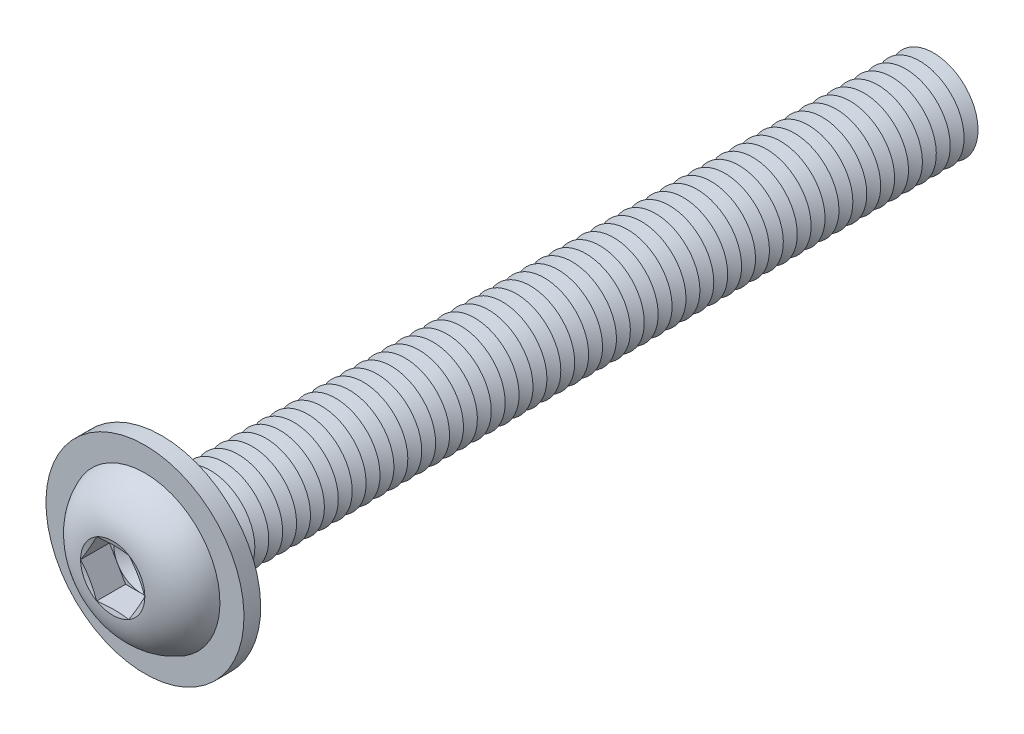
ISO-10303-21;
HEADER;
FILE_DESCRIPTION(('STEP AP214'),'2;1');
FILE_NAME('part.step','',(''),(''),'','','');
FILE_SCHEMA(('AUTOMOTIVE_DESIGN { 1 0 10303 214 1 1 1 1 }'));
ENDSEC;
DATA;
#1=APPLICATION_CONTEXT('core data for automotive mechanical design processes');
#2=APPLICATION_PROTOCOL_DEFINITION('international standard','automotive_design',2000,#1);
#3=PRODUCT_CONTEXT('',#1,'mechanical');
#4=PRODUCT('Part','Part','',(#3));
#5=PRODUCT_RELATED_PRODUCT_CATEGORY('part','',(#4));
#6=PRODUCT_DEFINITION_FORMATION('','',#4);
#7=PRODUCT_DEFINITION_CONTEXT('part definition',#1,'design');
#8=PRODUCT_DEFINITION('design','',#6,#7);
#9=PRODUCT_DEFINITION_SHAPE('','',#8);
#10=(LENGTH_UNIT() NAMED_UNIT(*) SI_UNIT(.MILLI.,.METRE.));
#11=(NAMED_UNIT(*) PLANE_ANGLE_UNIT() SI_UNIT($,.RADIAN.));
#12=(NAMED_UNIT(*) SI_UNIT($,.STERADIAN.) SOLID_ANGLE_UNIT());
#13=UNCERTAINTY_MEASURE_WITH_UNIT(LENGTH_MEASURE(1.E-05),#10,'distance_accuracy_value','');
#14=(GEOMETRIC_REPRESENTATION_CONTEXT(3) GLOBAL_UNCERTAINTY_ASSIGNED_CONTEXT((#13)) GLOBAL_UNIT_ASSIGNED_CONTEXT((#10,
#11,#12)) REPRESENTATION_CONTEXT('',''));
#15=CARTESIAN_POINT('',(0.,0.,0.));
#16=DIRECTION('',(0.,0.,1.));
#17=DIRECTION('',(1.,0.,0.));
#18=AXIS2_PLACEMENT_3D('',#15,#16,#17);
#19=CARTESIAN_POINT('',(0.,0.,-65.625));
#20=DIRECTION('',(0.,0.,1.));
#21=DIRECTION('',(0.,-1.,0.));
#22=AXIS2_PLACEMENT_3D('',#19,#20,#21);
#23=CONICAL_SURFACE('',#22,3.99999999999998,1.0471975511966);
#24=CARTESIAN_POINT('',(0.,0.,-66.25));
#25=DIRECTION('',(0.,0.,1.));
#26=DIRECTION('',(0.,-1.,0.));
#27=AXIS2_PLACEMENT_3D('',#24,#25,#26);
#28=CIRCLE('',#27,2.91746824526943);
#29=CARTESIAN_POINT('',(0.,-2.91746824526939,-66.25));
#30=VERTEX_POINT('',#29);
#31=EDGE_CURVE('E656',#30,#30,#28,.T.);
#32=ORIENTED_EDGE('',*,*,#31,.T.);
#33=EDGE_LOOP('',(#32));
#34=FACE_BOUND('',#33,.T.);
#35=CARTESIAN_POINT('',(0.,0.,-65.625));
#36=DIRECTION('',(0.,0.,1.));
#37=DIRECTION('',(0.,-1.,0.));
#38=AXIS2_PLACEMENT_3D('',#35,#36,#37);
#39=CIRCLE('',#38,3.99999999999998);
#40=CARTESIAN_POINT('',(0.,-3.99999999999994,-65.625));
#41=VERTEX_POINT('',#40);
#42=EDGE_CURVE('E652',#41,#41,#39,.T.);
#43=ORIENTED_EDGE('',*,*,#42,.F.);
#44=EDGE_LOOP('',(#43));
#45=FACE_BOUND('',#44,.T.);
#46=ADVANCED_FACE('F39',(#34,#45),#23,.T.);
#47=CARTESIAN_POINT('',(0.,0.,-66.25));
#48=DIRECTION('',(0.,0.,-1.));
#49=DIRECTION('',(0.,1.,0.));
#50=AXIS2_PLACEMENT_3D('',#47,#48,#49);
#51=CONICAL_SURFACE('',#50,2.91746824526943,1.0471975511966);
#52=CARTESIAN_POINT('',(0.,0.,-66.875));
#53=DIRECTION('',(0.,0.,1.));
#54=DIRECTION('',(0.,-1.,0.));
#55=AXIS2_PLACEMENT_3D('',#52,#53,#54);
#56=CIRCLE('',#55,3.99999999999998);
#57=CARTESIAN_POINT('',(0.,-3.99999999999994,-66.875));
#58=VERTEX_POINT('',#57);
#59=EDGE_CURVE('E660',#58,#58,#56,.T.);
#60=ORIENTED_EDGE('',*,*,#59,.T.);
#61=EDGE_LOOP('',(#60));
#62=FACE_BOUND('',#61,.T.);
#63=ORIENTED_EDGE('',*,*,#31,.F.);
#64=EDGE_LOOP('',(#63));
#65=FACE_BOUND('',#64,.T.);
#66=ADVANCED_FACE('F776',(#62,#65),#51,.T.);
#67=CARTESIAN_POINT('',(0.,3.99999999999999,-70.));
#68=DIRECTION('',(0.,0.,-1.));
#69=DIRECTION('',(0.,1.,0.));
#70=AXIS2_PLACEMENT_3D('',#67,#68,#69);
#71=PLANE('',#70);
#72=CARTESIAN_POINT('',(0.,0.,-70.));
#73=DIRECTION('',(0.,0.,1.));
#74=DIRECTION('',(0.,-1.,0.));
#75=AXIS2_PLACEMENT_3D('',#72,#73,#74);
#76=CIRCLE('',#75,2.91746824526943);
#77=CARTESIAN_POINT('',(0.,-2.91746824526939,-70.));
#78=VERTEX_POINT('',#77);
#79=EDGE_CURVE('E680',#78,#78,#76,.T.);
#80=ORIENTED_EDGE('',*,*,#79,.F.);
#81=EDGE_LOOP('',(#80));
#82=FACE_BOUND('',#81,.T.);
#83=ADVANCED_FACE('F782',(#82),#71,.T.);
#84=CARTESIAN_POINT('',(0.,0.,-69.375));
#85=DIRECTION('',(0.,0.,1.));
#86=DIRECTION('',(0.,-1.,0.));
#87=AXIS2_PLACEMENT_3D('',#84,#85,#86);
#88=CONICAL_SURFACE('',#87,3.99999999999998,1.0471975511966);
#89=ORIENTED_EDGE('',*,*,#79,.T.);
#90=EDGE_LOOP('',(#89));
#91=FACE_BOUND('',#90,.T.);
#92=CARTESIAN_POINT('',(0.,0.,-69.375));
#93=DIRECTION('',(0.,0.,1.));
#94=DIRECTION('',(0.,-1.,0.));
#95=AXIS2_PLACEMENT_3D('',#92,#93,#94);
#96=CIRCLE('',#95,3.99999999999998);
#97=CARTESIAN_POINT('',(0.,-3.99999999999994,-69.375));
#98=VERTEX_POINT('',#97);
#99=EDGE_CURVE('E676',#98,#98,#96,.T.);
#100=ORIENTED_EDGE('',*,*,#99,.F.);
#101=EDGE_LOOP('',(#100));
#102=FACE_BOUND('',#101,.T.);
#103=ADVANCED_FACE('F801',(#91,#102),#88,.T.);
#104=CARTESIAN_POINT('',(0.,0.,-68.75));
#105=DIRECTION('',(0.,0.,-1.));
#106=DIRECTION('',(0.,1.,0.));
#107=AXIS2_PLACEMENT_3D('',#104,#105,#106);
#108=CONICAL_SURFACE('',#107,2.91746824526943,1.0471975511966);
#109=ORIENTED_EDGE('',*,*,#99,.T.);
#110=EDGE_LOOP('',(#109));
#111=FACE_BOUND('',#110,.T.);
#112=CARTESIAN_POINT('',(0.,0.,-68.75));
#113=DIRECTION('',(0.,0.,1.));
#114=DIRECTION('',(0.,-1.,0.));
#115=AXIS2_PLACEMENT_3D('',#112,#113,#114);
#116=CIRCLE('',#115,2.91746824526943);
#117=CARTESIAN_POINT('',(0.,-2.91746824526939,-68.75));
#118=VERTEX_POINT('',#117);
#119=EDGE_CURVE('E672',#118,#118,#116,.T.);
#120=ORIENTED_EDGE('',*,*,#119,.F.);
#121=EDGE_LOOP('',(#120));
#122=FACE_BOUND('',#121,.T.);
#123=ADVANCED_FACE('F798',(#111,#122),#108,.T.);
#124=CARTESIAN_POINT('',(0.,0.,-68.125));
#125=DIRECTION('',(0.,0.,1.));
#126=DIRECTION('',(0.,-1.,0.));
#127=AXIS2_PLACEMENT_3D('',#124,#125,#126);
#128=CONICAL_SURFACE('',#127,3.99999999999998,1.0471975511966);
#129=ORIENTED_EDGE('',*,*,#119,.T.);
#130=EDGE_LOOP('',(#129));
#131=FACE_BOUND('',#130,.T.);
#132=CARTESIAN_POINT('',(0.,0.,-68.125));
#133=DIRECTION('',(0.,0.,1.));
#134=DIRECTION('',(0.,-1.,0.));
#135=AXIS2_PLACEMENT_3D('',#132,#133,#134);
#136=CIRCLE('',#135,3.99999999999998);
#137=CARTESIAN_POINT('',(0.,-3.99999999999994,-68.125));
#138=VERTEX_POINT('',#137);
#139=EDGE_CURVE('E668',#138,#138,#136,.T.);
#140=ORIENTED_EDGE('',*,*,#139,.F.);
#141=EDGE_LOOP('',(#140));
#142=FACE_BOUND('',#141,.T.);
#143=ADVANCED_FACE('F792',(#131,#142),#128,.T.);
#144=CARTESIAN_POINT('',(0.,0.,-67.5));
#145=DIRECTION('',(0.,0.,-1.));
#146=DIRECTION('',(0.,1.,0.));
#147=AXIS2_PLACEMENT_3D('',#144,#145,#146);
#148=CONICAL_SURFACE('',#147,2.91746824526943,1.0471975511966);
#149=ORIENTED_EDGE('',*,*,#139,.T.);
#150=EDGE_LOOP('',(#149));
#151=FACE_BOUND('',#150,.T.);
#152=CARTESIAN_POINT('',(0.,0.,-67.5));
#153=DIRECTION('',(0.,0.,1.));
#154=DIRECTION('',(0.,-1.,0.));
#155=AXIS2_PLACEMENT_3D('',#152,#153,#154);
#156=CIRCLE('',#155,2.91746824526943);
#157=CARTESIAN_POINT('',(0.,-2.91746824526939,-67.5));
#158=VERTEX_POINT('',#157);
#159=EDGE_CURVE('E664',#158,#158,#156,.T.);
#160=ORIENTED_EDGE('',*,*,#159,.F.);
#161=EDGE_LOOP('',(#160));
#162=FACE_BOUND('',#161,.T.);
#163=ADVANCED_FACE('F788',(#151,#162),#148,.T.);
#164=CARTESIAN_POINT('',(0.,0.,-66.875));
#165=DIRECTION('',(0.,0.,1.));
#166=DIRECTION('',(0.,-1.,0.));
#167=AXIS2_PLACEMENT_3D('',#164,#165,#166);
#168=CONICAL_SURFACE('',#167,3.99999999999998,1.0471975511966);
#169=ORIENTED_EDGE('',*,*,#159,.T.);
#170=EDGE_LOOP('',(#169));
#171=FACE_BOUND('',#170,.T.);
#172=ORIENTED_EDGE('',*,*,#59,.F.);
#173=EDGE_LOOP('',(#172));
#174=FACE_BOUND('',#173,.T.);
#175=ADVANCED_FACE('F791',(#171,#174),#168,.T.);
#176=CARTESIAN_POINT('',(0.,0.,-64.375));
#177=DIRECTION('',(0.,0.,1.));
#178=DIRECTION('',(0.,-1.,0.));
#179=AXIS2_PLACEMENT_3D('',#176,#177,#178);
#180=CONICAL_SURFACE('',#179,3.99999999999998,1.0471975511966);
#181=CARTESIAN_POINT('',(0.,0.,-65.));
#182=DIRECTION('',(0.,0.,1.));
#183=DIRECTION('',(0.,-1.,0.));
#184=AXIS2_PLACEMENT_3D('',#181,#182,#183);
#185=CIRCLE('',#184,2.91746824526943);
#186=CARTESIAN_POINT('',(0.,-2.9174682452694,-65.));
#187=VERTEX_POINT('',#186);
#188=EDGE_CURVE('E648',#187,#187,#185,.T.);
#189=ORIENTED_EDGE('',*,*,#188,.T.);
#190=EDGE_LOOP('',(#189));
#191=FACE_BOUND('',#190,.T.);
#192=CARTESIAN_POINT('',(0.,0.,-64.375));
#193=DIRECTION('',(0.,0.,1.));
#194=DIRECTION('',(0.,-1.,0.));
#195=AXIS2_PLACEMENT_3D('',#192,#193,#194);
#196=CIRCLE('',#195,3.99999999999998);
#197=CARTESIAN_POINT('',(0.,-3.99999999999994,-64.375));
#198=VERTEX_POINT('',#197);
#199=EDGE_CURVE('E644',#198,#198,#196,.T.);
#200=ORIENTED_EDGE('',*,*,#199,.F.);
#201=EDGE_LOOP('',(#200));
#202=FACE_BOUND('',#201,.T.);
#203=ADVANCED_FACE('F796',(#191,#202),#180,.T.);
#204=CARTESIAN_POINT('',(0.,0.,-65.));
#205=DIRECTION('',(0.,0.,-1.));
#206=DIRECTION('',(0.,1.,0.));
#207=AXIS2_PLACEMENT_3D('',#204,#205,#206);
#208=CONICAL_SURFACE('',#207,2.91746824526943,1.0471975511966);
#209=ORIENTED_EDGE('',*,*,#42,.T.);
#210=EDGE_LOOP('',(#209));
#211=FACE_BOUND('',#210,.T.);
#212=ORIENTED_EDGE('',*,*,#188,.F.);
#213=EDGE_LOOP('',(#212));
#214=FACE_BOUND('',#213,.T.);
#215=ADVANCED_FACE('F847',(#211,#214),#208,.T.);
#216=CARTESIAN_POINT('',(0.,0.,-63.125));
#217=DIRECTION('',(0.,0.,1.));
#218=DIRECTION('',(0.,-1.,0.));
#219=AXIS2_PLACEMENT_3D('',#216,#217,#218);
#220=CONICAL_SURFACE('',#219,3.99999999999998,1.0471975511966);
#221=CARTESIAN_POINT('',(0.,0.,-63.75));
#222=DIRECTION('',(0.,0.,1.));
#223=DIRECTION('',(0.,-1.,0.));
#224=AXIS2_PLACEMENT_3D('',#221,#222,#223);
#225=CIRCLE('',#224,2.91746824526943);
#226=CARTESIAN_POINT('',(0.,-2.9174682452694,-63.75));
#227=VERTEX_POINT('',#226);
#228=EDGE_CURVE('E640',#227,#227,#225,.T.);
#229=ORIENTED_EDGE('',*,*,#228,.T.);
#230=EDGE_LOOP('',(#229));
#231=FACE_BOUND('',#230,.T.);
#232=CARTESIAN_POINT('',(0.,0.,-63.125));
#233=DIRECTION('',(0.,0.,1.));
#234=DIRECTION('',(0.,-1.,0.));
#235=AXIS2_PLACEMENT_3D('',#232,#233,#234);
#236=CIRCLE('',#235,3.99999999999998);
#237=CARTESIAN_POINT('',(0.,-3.99999999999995,-63.125));
#238=VERTEX_POINT('',#237);
#239=EDGE_CURVE('E636',#238,#238,#236,.T.);
#240=ORIENTED_EDGE('',*,*,#239,.F.);
#241=EDGE_LOOP('',(#240));
#242=FACE_BOUND('',#241,.T.);
#243=ADVANCED_FACE('F853',(#231,#242),#220,.T.);
#244=CARTESIAN_POINT('',(0.,0.,-63.75));
#245=DIRECTION('',(0.,0.,-1.));
#246=DIRECTION('',(0.,1.,0.));
#247=AXIS2_PLACEMENT_3D('',#244,#245,#246);
#248=CONICAL_SURFACE('',#247,2.91746824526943,1.0471975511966);
#249=ORIENTED_EDGE('',*,*,#199,.T.);
#250=EDGE_LOOP('',(#249));
#251=FACE_BOUND('',#250,.T.);
#252=ORIENTED_EDGE('',*,*,#228,.F.);
#253=EDGE_LOOP('',(#252));
#254=FACE_BOUND('',#253,.T.);
#255=ADVANCED_FACE('F860',(#251,#254),#248,.T.);
#256=CARTESIAN_POINT('',(0.,0.,-61.875));
#257=DIRECTION('',(0.,0.,1.));
#258=DIRECTION('',(0.,-1.,0.));
#259=AXIS2_PLACEMENT_3D('',#256,#257,#258);
#260=CONICAL_SURFACE('',#259,3.99999999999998,1.0471975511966);
#261=CARTESIAN_POINT('',(0.,0.,-62.5));
#262=DIRECTION('',(0.,0.,1.));
#263=DIRECTION('',(0.,-1.,0.));
#264=AXIS2_PLACEMENT_3D('',#261,#262,#263);
#265=CIRCLE('',#264,2.91746824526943);
#266=CARTESIAN_POINT('',(0.,-2.9174682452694,-62.5));
#267=VERTEX_POINT('',#266);
#268=EDGE_CURVE('E632',#267,#267,#265,.T.);
#269=ORIENTED_EDGE('',*,*,#268,.T.);
#270=EDGE_LOOP('',(#269));
#271=FACE_BOUND('',#270,.T.);
#272=CARTESIAN_POINT('',(0.,0.,-61.875));
#273=DIRECTION('',(0.,0.,1.));
#274=DIRECTION('',(0.,-1.,0.));
#275=AXIS2_PLACEMENT_3D('',#272,#273,#274);
#276=CIRCLE('',#275,3.99999999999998);
#277=CARTESIAN_POINT('',(0.,-3.99999999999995,-61.875));
#278=VERTEX_POINT('',#277);
#279=EDGE_CURVE('E628',#278,#278,#276,.T.);
#280=ORIENTED_EDGE('',*,*,#279,.F.);
#281=EDGE_LOOP('',(#280));
#282=FACE_BOUND('',#281,.T.);
#283=ADVANCED_FACE('F867',(#271,#282),#260,.T.);
#284=CARTESIAN_POINT('',(0.,0.,-62.5));
#285=DIRECTION('',(0.,0.,-1.));
#286=DIRECTION('',(0.,1.,0.));
#287=AXIS2_PLACEMENT_3D('',#284,#285,#286);
#288=CONICAL_SURFACE('',#287,2.91746824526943,1.0471975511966);
#289=ORIENTED_EDGE('',*,*,#239,.T.);
#290=EDGE_LOOP('',(#289));
#291=FACE_BOUND('',#290,.T.);
#292=ORIENTED_EDGE('',*,*,#268,.F.);
#293=EDGE_LOOP('',(#292));
#294=FACE_BOUND('',#293,.T.);
#295=ADVANCED_FACE('F874',(#291,#294),#288,.T.);
#296=CARTESIAN_POINT('',(0.,0.,-60.625));
#297=DIRECTION('',(0.,0.,1.));
#298=DIRECTION('',(0.,-1.,0.));
#299=AXIS2_PLACEMENT_3D('',#296,#297,#298);
#300=CONICAL_SURFACE('',#299,3.99999999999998,1.0471975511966);
#301=CARTESIAN_POINT('',(0.,0.,-61.25));
#302=DIRECTION('',(0.,0.,1.));
#303=DIRECTION('',(0.,-1.,0.));
#304=AXIS2_PLACEMENT_3D('',#301,#302,#303);
#305=CIRCLE('',#304,2.91746824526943);
#306=CARTESIAN_POINT('',(0.,-2.9174682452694,-61.25));
#307=VERTEX_POINT('',#306);
#308=EDGE_CURVE('E624',#307,#307,#305,.T.);
#309=ORIENTED_EDGE('',*,*,#308,.T.);
#310=EDGE_LOOP('',(#309));
#311=FACE_BOUND('',#310,.T.);
#312=CARTESIAN_POINT('',(0.,0.,-60.625));
#313=DIRECTION('',(0.,0.,1.));
#314=DIRECTION('',(0.,-1.,0.));
#315=AXIS2_PLACEMENT_3D('',#312,#313,#314);
#316=CIRCLE('',#315,3.99999999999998);
#317=CARTESIAN_POINT('',(0.,-3.99999999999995,-60.625));
#318=VERTEX_POINT('',#317);
#319=EDGE_CURVE('E620',#318,#318,#316,.T.);
#320=ORIENTED_EDGE('',*,*,#319,.F.);
#321=EDGE_LOOP('',(#320));
#322=FACE_BOUND('',#321,.T.);
#323=ADVANCED_FACE('F881',(#311,#322),#300,.T.);
#324=CARTESIAN_POINT('',(0.,0.,-61.25));
#325=DIRECTION('',(0.,0.,-1.));
#326=DIRECTION('',(0.,1.,0.));
#327=AXIS2_PLACEMENT_3D('',#324,#325,#326);
#328=CONICAL_SURFACE('',#327,2.91746824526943,1.0471975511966);
#329=ORIENTED_EDGE('',*,*,#279,.T.);
#330=EDGE_LOOP('',(#329));
#331=FACE_BOUND('',#330,.T.);
#332=ORIENTED_EDGE('',*,*,#308,.F.);
#333=EDGE_LOOP('',(#332));
#334=FACE_BOUND('',#333,.T.);
#335=ADVANCED_FACE('F888',(#331,#334),#328,.T.);
#336=CARTESIAN_POINT('',(0.,0.,-59.375));
#337=DIRECTION('',(0.,0.,1.));
#338=DIRECTION('',(0.,-1.,0.));
#339=AXIS2_PLACEMENT_3D('',#336,#337,#338);
#340=CONICAL_SURFACE('',#339,3.99999999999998,1.0471975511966);
#341=CARTESIAN_POINT('',(0.,0.,-60.));
#342=DIRECTION('',(0.,0.,1.));
#343=DIRECTION('',(0.,-1.,0.));
#344=AXIS2_PLACEMENT_3D('',#341,#342,#343);
#345=CIRCLE('',#344,2.91746824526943);
#346=CARTESIAN_POINT('',(0.,-2.9174682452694,-60.));
#347=VERTEX_POINT('',#346);
#348=EDGE_CURVE('E616',#347,#347,#345,.T.);
#349=ORIENTED_EDGE('',*,*,#348,.T.);
#350=EDGE_LOOP('',(#349));
#351=FACE_BOUND('',#350,.T.);
#352=CARTESIAN_POINT('',(0.,0.,-59.375));
#353=DIRECTION('',(0.,0.,1.));
#354=DIRECTION('',(0.,-1.,0.));
#355=AXIS2_PLACEMENT_3D('',#352,#353,#354);
#356=CIRCLE('',#355,3.99999999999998);
#357=CARTESIAN_POINT('',(0.,-3.99999999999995,-59.375));
#358=VERTEX_POINT('',#357);
#359=EDGE_CURVE('E612',#358,#358,#356,.T.);
#360=ORIENTED_EDGE('',*,*,#359,.F.);
#361=EDGE_LOOP('',(#360));
#362=FACE_BOUND('',#361,.T.);
#363=ADVANCED_FACE('F895',(#351,#362),#340,.T.);
#364=CARTESIAN_POINT('',(0.,0.,-60.));
#365=DIRECTION('',(0.,0.,-1.));
#366=DIRECTION('',(0.,1.,0.));
#367=AXIS2_PLACEMENT_3D('',#364,#365,#366);
#368=CONICAL_SURFACE('',#367,2.91746824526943,1.0471975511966);
#369=ORIENTED_EDGE('',*,*,#319,.T.);
#370=EDGE_LOOP('',(#369));
#371=FACE_BOUND('',#370,.T.);
#372=ORIENTED_EDGE('',*,*,#348,.F.);
#373=EDGE_LOOP('',(#372));
#374=FACE_BOUND('',#373,.T.);
#375=ADVANCED_FACE('F902',(#371,#374),#368,.T.);
#376=CARTESIAN_POINT('',(0.,0.,-58.125));
#377=DIRECTION('',(0.,0.,1.));
#378=DIRECTION('',(0.,-1.,0.));
#379=AXIS2_PLACEMENT_3D('',#376,#377,#378);
#380=CONICAL_SURFACE('',#379,3.99999999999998,1.0471975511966);
#381=CARTESIAN_POINT('',(0.,0.,-58.75));
#382=DIRECTION('',(0.,0.,1.));
#383=DIRECTION('',(0.,-1.,0.));
#384=AXIS2_PLACEMENT_3D('',#381,#382,#383);
#385=CIRCLE('',#384,2.91746824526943);
#386=CARTESIAN_POINT('',(0.,-2.9174682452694,-58.75));
#387=VERTEX_POINT('',#386);
#388=EDGE_CURVE('E608',#387,#387,#385,.T.);
#389=ORIENTED_EDGE('',*,*,#388,.T.);
#390=EDGE_LOOP('',(#389));
#391=FACE_BOUND('',#390,.T.);
#392=CARTESIAN_POINT('',(0.,0.,-58.125));
#393=DIRECTION('',(0.,0.,1.));
#394=DIRECTION('',(0.,-1.,0.));
#395=AXIS2_PLACEMENT_3D('',#392,#393,#394);
#396=CIRCLE('',#395,3.99999999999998);
#397=CARTESIAN_POINT('',(0.,-3.99999999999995,-58.125));
#398=VERTEX_POINT('',#397);
#399=EDGE_CURVE('E604',#398,#398,#396,.T.);
#400=ORIENTED_EDGE('',*,*,#399,.F.);
#401=EDGE_LOOP('',(#400));
#402=FACE_BOUND('',#401,.T.);
#403=ADVANCED_FACE('F909',(#391,#402),#380,.T.);
#404=CARTESIAN_POINT('',(0.,0.,-58.75));
#405=DIRECTION('',(0.,0.,-1.));
#406=DIRECTION('',(0.,1.,0.));
#407=AXIS2_PLACEMENT_3D('',#404,#405,#406);
#408=CONICAL_SURFACE('',#407,2.91746824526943,1.0471975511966);
#409=ORIENTED_EDGE('',*,*,#359,.T.);
#410=EDGE_LOOP('',(#409));
#411=FACE_BOUND('',#410,.T.);
#412=ORIENTED_EDGE('',*,*,#388,.F.);
#413=EDGE_LOOP('',(#412));
#414=FACE_BOUND('',#413,.T.);
#415=ADVANCED_FACE('F916',(#411,#414),#408,.T.);
#416=CARTESIAN_POINT('',(0.,0.,-56.875));
#417=DIRECTION('',(0.,0.,1.));
#418=DIRECTION('',(0.,-1.,0.));
#419=AXIS2_PLACEMENT_3D('',#416,#417,#418);
#420=CONICAL_SURFACE('',#419,3.99999999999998,1.0471975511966);
#421=CARTESIAN_POINT('',(0.,0.,-57.5));
#422=DIRECTION('',(0.,0.,1.));
#423=DIRECTION('',(0.,-1.,0.));
#424=AXIS2_PLACEMENT_3D('',#421,#422,#423);
#425=CIRCLE('',#424,2.91746824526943);
#426=CARTESIAN_POINT('',(0.,-2.9174682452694,-57.5));
#427=VERTEX_POINT('',#426);
#428=EDGE_CURVE('E600',#427,#427,#425,.T.);
#429=ORIENTED_EDGE('',*,*,#428,.T.);
#430=EDGE_LOOP('',(#429));
#431=FACE_BOUND('',#430,.T.);
#432=CARTESIAN_POINT('',(0.,0.,-56.875));
#433=DIRECTION('',(0.,0.,1.));
#434=DIRECTION('',(0.,-1.,0.));
#435=AXIS2_PLACEMENT_3D('',#432,#433,#434);
#436=CIRCLE('',#435,3.99999999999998);
#437=CARTESIAN_POINT('',(0.,-3.99999999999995,-56.875));
#438=VERTEX_POINT('',#437);
#439=EDGE_CURVE('E596',#438,#438,#436,.T.);
#440=ORIENTED_EDGE('',*,*,#439,.F.);
#441=EDGE_LOOP('',(#440));
#442=FACE_BOUND('',#441,.T.);
#443=ADVANCED_FACE('F923',(#431,#442),#420,.T.);
#444=CARTESIAN_POINT('',(0.,0.,-57.5));
#445=DIRECTION('',(0.,0.,-1.));
#446=DIRECTION('',(0.,1.,0.));
#447=AXIS2_PLACEMENT_3D('',#444,#445,#446);
#448=CONICAL_SURFACE('',#447,2.91746824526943,1.0471975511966);
#449=ORIENTED_EDGE('',*,*,#399,.T.);
#450=EDGE_LOOP('',(#449));
#451=FACE_BOUND('',#450,.T.);
#452=ORIENTED_EDGE('',*,*,#428,.F.);
#453=EDGE_LOOP('',(#452));
#454=FACE_BOUND('',#453,.T.);
#455=ADVANCED_FACE('F930',(#451,#454),#448,.T.);
#456=CARTESIAN_POINT('',(0.,0.,-55.625));
#457=DIRECTION('',(0.,0.,1.));
#458=DIRECTION('',(0.,-1.,0.));
#459=AXIS2_PLACEMENT_3D('',#456,#457,#458);
#460=CONICAL_SURFACE('',#459,3.99999999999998,1.0471975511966);
#461=CARTESIAN_POINT('',(0.,0.,-56.25));
#462=DIRECTION('',(0.,0.,1.));
#463=DIRECTION('',(0.,-1.,0.));
#464=AXIS2_PLACEMENT_3D('',#461,#462,#463);
#465=CIRCLE('',#464,2.91746824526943);
#466=CARTESIAN_POINT('',(0.,-2.9174682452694,-56.25));
#467=VERTEX_POINT('',#466);
#468=EDGE_CURVE('E592',#467,#467,#465,.T.);
#469=ORIENTED_EDGE('',*,*,#468,.T.);
#470=EDGE_LOOP('',(#469));
#471=FACE_BOUND('',#470,.T.);
#472=CARTESIAN_POINT('',(0.,0.,-55.625));
#473=DIRECTION('',(0.,0.,1.));
#474=DIRECTION('',(0.,-1.,0.));
#475=AXIS2_PLACEMENT_3D('',#472,#473,#474);
#476=CIRCLE('',#475,3.99999999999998);
#477=CARTESIAN_POINT('',(0.,-3.99999999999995,-55.625));
#478=VERTEX_POINT('',#477);
#479=EDGE_CURVE('E588',#478,#478,#476,.T.);
#480=ORIENTED_EDGE('',*,*,#479,.F.);
#481=EDGE_LOOP('',(#480));
#482=FACE_BOUND('',#481,.T.);
#483=ADVANCED_FACE('F937',(#471,#482),#460,.T.);
#484=CARTESIAN_POINT('',(0.,0.,-56.25));
#485=DIRECTION('',(0.,0.,-1.));
#486=DIRECTION('',(0.,1.,0.));
#487=AXIS2_PLACEMENT_3D('',#484,#485,#486);
#488=CONICAL_SURFACE('',#487,2.91746824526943,1.0471975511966);
#489=ORIENTED_EDGE('',*,*,#439,.T.);
#490=EDGE_LOOP('',(#489));
#491=FACE_BOUND('',#490,.T.);
#492=ORIENTED_EDGE('',*,*,#468,.F.);
#493=EDGE_LOOP('',(#492));
#494=FACE_BOUND('',#493,.T.);
#495=ADVANCED_FACE('F944',(#491,#494),#488,.T.);
#496=CARTESIAN_POINT('',(0.,0.,-54.375));
#497=DIRECTION('',(0.,0.,1.));
#498=DIRECTION('',(0.,-1.,0.));
#499=AXIS2_PLACEMENT_3D('',#496,#497,#498);
#500=CONICAL_SURFACE('',#499,3.99999999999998,1.0471975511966);
#501=CARTESIAN_POINT('',(0.,0.,-55.));
#502=DIRECTION('',(0.,0.,1.));
#503=DIRECTION('',(0.,-1.,0.));
#504=AXIS2_PLACEMENT_3D('',#501,#502,#503);
#505=CIRCLE('',#504,2.91746824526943);
#506=CARTESIAN_POINT('',(0.,-2.9174682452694,-55.));
#507=VERTEX_POINT('',#506);
#508=EDGE_CURVE('E584',#507,#507,#505,.T.);
#509=ORIENTED_EDGE('',*,*,#508,.T.);
#510=EDGE_LOOP('',(#509));
#511=FACE_BOUND('',#510,.T.);
#512=CARTESIAN_POINT('',(0.,0.,-54.375));
#513=DIRECTION('',(0.,0.,1.));
#514=DIRECTION('',(0.,-1.,0.));
#515=AXIS2_PLACEMENT_3D('',#512,#513,#514);
#516=CIRCLE('',#515,3.99999999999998);
#517=CARTESIAN_POINT('',(0.,-3.99999999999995,-54.375));
#518=VERTEX_POINT('',#517);
#519=EDGE_CURVE('E580',#518,#518,#516,.T.);
#520=ORIENTED_EDGE('',*,*,#519,.F.);
#521=EDGE_LOOP('',(#520));
#522=FACE_BOUND('',#521,.T.);
#523=ADVANCED_FACE('F951',(#511,#522),#500,.T.);
#524=CARTESIAN_POINT('',(0.,0.,-55.));
#525=DIRECTION('',(0.,0.,-1.));
#526=DIRECTION('',(0.,1.,0.));
#527=AXIS2_PLACEMENT_3D('',#524,#525,#526);
#528=CONICAL_SURFACE('',#527,2.91746824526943,1.0471975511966);
#529=ORIENTED_EDGE('',*,*,#479,.T.);
#530=EDGE_LOOP('',(#529));
#531=FACE_BOUND('',#530,.T.);
#532=ORIENTED_EDGE('',*,*,#508,.F.);
#533=EDGE_LOOP('',(#532));
#534=FACE_BOUND('',#533,.T.);
#535=ADVANCED_FACE('F958',(#531,#534),#528,.T.);
#536=CARTESIAN_POINT('',(0.,0.,-53.125));
#537=DIRECTION('',(0.,0.,1.));
#538=DIRECTION('',(0.,-1.,0.));
#539=AXIS2_PLACEMENT_3D('',#536,#537,#538);
#540=CONICAL_SURFACE('',#539,3.99999999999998,1.0471975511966);
#541=CARTESIAN_POINT('',(0.,0.,-53.75));
#542=DIRECTION('',(0.,0.,1.));
#543=DIRECTION('',(0.,-1.,0.));
#544=AXIS2_PLACEMENT_3D('',#541,#542,#543);
#545=CIRCLE('',#544,2.91746824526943);
#546=CARTESIAN_POINT('',(0.,-2.9174682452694,-53.75));
#547=VERTEX_POINT('',#546);
#548=EDGE_CURVE('E576',#547,#547,#545,.T.);
#549=ORIENTED_EDGE('',*,*,#548,.T.);
#550=EDGE_LOOP('',(#549));
#551=FACE_BOUND('',#550,.T.);
#552=CARTESIAN_POINT('',(0.,0.,-53.125));
#553=DIRECTION('',(0.,0.,1.));
#554=DIRECTION('',(0.,-1.,0.));
#555=AXIS2_PLACEMENT_3D('',#552,#553,#554);
#556=CIRCLE('',#555,3.99999999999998);
#557=CARTESIAN_POINT('',(0.,-3.99999999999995,-53.125));
#558=VERTEX_POINT('',#557);
#559=EDGE_CURVE('E572',#558,#558,#556,.T.);
#560=ORIENTED_EDGE('',*,*,#559,.F.);
#561=EDGE_LOOP('',(#560));
#562=FACE_BOUND('',#561,.T.);
#563=ADVANCED_FACE('F965',(#551,#562),#540,.T.);
#564=CARTESIAN_POINT('',(0.,0.,-53.75));
#565=DIRECTION('',(0.,0.,-1.));
#566=DIRECTION('',(0.,1.,0.));
#567=AXIS2_PLACEMENT_3D('',#564,#565,#566);
#568=CONICAL_SURFACE('',#567,2.91746824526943,1.0471975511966);
#569=ORIENTED_EDGE('',*,*,#519,.T.);
#570=EDGE_LOOP('',(#569));
#571=FACE_BOUND('',#570,.T.);
#572=ORIENTED_EDGE('',*,*,#548,.F.);
#573=EDGE_LOOP('',(#572));
#574=FACE_BOUND('',#573,.T.);
#575=ADVANCED_FACE('F972',(#571,#574),#568,.T.);
#576=CARTESIAN_POINT('',(0.,0.,-51.875));
#577=DIRECTION('',(0.,0.,1.));
#578=DIRECTION('',(0.,-1.,0.));
#579=AXIS2_PLACEMENT_3D('',#576,#577,#578);
#580=CONICAL_SURFACE('',#579,3.99999999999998,1.0471975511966);
#581=CARTESIAN_POINT('',(0.,0.,-52.5));
#582=DIRECTION('',(0.,0.,1.));
#583=DIRECTION('',(0.,-1.,0.));
#584=AXIS2_PLACEMENT_3D('',#581,#582,#583);
#585=CIRCLE('',#584,2.91746824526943);
#586=CARTESIAN_POINT('',(0.,-2.9174682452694,-52.5));
#587=VERTEX_POINT('',#586);
#588=EDGE_CURVE('E568',#587,#587,#585,.T.);
#589=ORIENTED_EDGE('',*,*,#588,.T.);
#590=EDGE_LOOP('',(#589));
#591=FACE_BOUND('',#590,.T.);
#592=CARTESIAN_POINT('',(0.,0.,-51.875));
#593=DIRECTION('',(0.,0.,1.));
#594=DIRECTION('',(0.,-1.,0.));
#595=AXIS2_PLACEMENT_3D('',#592,#593,#594);
#596=CIRCLE('',#595,3.99999999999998);
#597=CARTESIAN_POINT('',(0.,-3.99999999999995,-51.875));
#598=VERTEX_POINT('',#597);
#599=EDGE_CURVE('E564',#598,#598,#596,.T.);
#600=ORIENTED_EDGE('',*,*,#599,.F.);
#601=EDGE_LOOP('',(#600));
#602=FACE_BOUND('',#601,.T.);
#603=ADVANCED_FACE('F979',(#591,#602),#580,.T.);
#604=CARTESIAN_POINT('',(0.,0.,-52.5));
#605=DIRECTION('',(0.,0.,-1.));
#606=DIRECTION('',(0.,1.,0.));
#607=AXIS2_PLACEMENT_3D('',#604,#605,#606);
#608=CONICAL_SURFACE('',#607,2.91746824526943,1.0471975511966);
#609=ORIENTED_EDGE('',*,*,#559,.T.);
#610=EDGE_LOOP('',(#609));
#611=FACE_BOUND('',#610,.T.);
#612=ORIENTED_EDGE('',*,*,#588,.F.);
#613=EDGE_LOOP('',(#612));
#614=FACE_BOUND('',#613,.T.);
#615=ADVANCED_FACE('F986',(#611,#614),#608,.T.);
#616=CARTESIAN_POINT('',(0.,0.,-50.625));
#617=DIRECTION('',(0.,0.,1.));
#618=DIRECTION('',(0.,-1.,0.));
#619=AXIS2_PLACEMENT_3D('',#616,#617,#618);
#620=CONICAL_SURFACE('',#619,3.99999999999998,1.0471975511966);
#621=CARTESIAN_POINT('',(0.,0.,-51.25));
#622=DIRECTION('',(0.,0.,1.));
#623=DIRECTION('',(0.,-1.,0.));
#624=AXIS2_PLACEMENT_3D('',#621,#622,#623);
#625=CIRCLE('',#624,2.91746824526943);
#626=CARTESIAN_POINT('',(0.,-2.9174682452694,-51.25));
#627=VERTEX_POINT('',#626);
#628=EDGE_CURVE('E560',#627,#627,#625,.T.);
#629=ORIENTED_EDGE('',*,*,#628,.T.);
#630=EDGE_LOOP('',(#629));
#631=FACE_BOUND('',#630,.T.);
#632=CARTESIAN_POINT('',(0.,0.,-50.625));
#633=DIRECTION('',(0.,0.,1.));
#634=DIRECTION('',(0.,-1.,0.));
#635=AXIS2_PLACEMENT_3D('',#632,#633,#634);
#636=CIRCLE('',#635,3.99999999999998);
#637=CARTESIAN_POINT('',(0.,-3.99999999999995,-50.625));
#638=VERTEX_POINT('',#637);
#639=EDGE_CURVE('E556',#638,#638,#636,.T.);
#640=ORIENTED_EDGE('',*,*,#639,.F.);
#641=EDGE_LOOP('',(#640));
#642=FACE_BOUND('',#641,.T.);
#643=ADVANCED_FACE('F993',(#631,#642),#620,.T.);
#644=CARTESIAN_POINT('',(0.,0.,-51.25));
#645=DIRECTION('',(0.,0.,-1.));
#646=DIRECTION('',(0.,1.,0.));
#647=AXIS2_PLACEMENT_3D('',#644,#645,#646);
#648=CONICAL_SURFACE('',#647,2.91746824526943,1.0471975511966);
#649=ORIENTED_EDGE('',*,*,#599,.T.);
#650=EDGE_LOOP('',(#649));
#651=FACE_BOUND('',#650,.T.);
#652=ORIENTED_EDGE('',*,*,#628,.F.);
#653=EDGE_LOOP('',(#652));
#654=FACE_BOUND('',#653,.T.);
#655=ADVANCED_FACE('F1000',(#651,#654),#648,.T.);
#656=CARTESIAN_POINT('',(0.,0.,-49.375));
#657=DIRECTION('',(0.,0.,1.));
#658=DIRECTION('',(0.,-1.,0.));
#659=AXIS2_PLACEMENT_3D('',#656,#657,#658);
#660=CONICAL_SURFACE('',#659,3.99999999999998,1.0471975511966);
#661=CARTESIAN_POINT('',(0.,0.,-50.));
#662=DIRECTION('',(0.,0.,1.));
#663=DIRECTION('',(0.,-1.,0.));
#664=AXIS2_PLACEMENT_3D('',#661,#662,#663);
#665=CIRCLE('',#664,2.91746824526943);
#666=CARTESIAN_POINT('',(0.,-2.9174682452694,-50.));
#667=VERTEX_POINT('',#666);
#668=EDGE_CURVE('E552',#667,#667,#665,.T.);
#669=ORIENTED_EDGE('',*,*,#668,.T.);
#670=EDGE_LOOP('',(#669));
#671=FACE_BOUND('',#670,.T.);
#672=CARTESIAN_POINT('',(0.,0.,-49.375));
#673=DIRECTION('',(0.,0.,1.));
#674=DIRECTION('',(0.,-1.,0.));
#675=AXIS2_PLACEMENT_3D('',#672,#673,#674);
#676=CIRCLE('',#675,3.99999999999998);
#677=CARTESIAN_POINT('',(0.,-3.99999999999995,-49.375));
#678=VERTEX_POINT('',#677);
#679=EDGE_CURVE('E548',#678,#678,#676,.T.);
#680=ORIENTED_EDGE('',*,*,#679,.F.);
#681=EDGE_LOOP('',(#680));
#682=FACE_BOUND('',#681,.T.);
#683=ADVANCED_FACE('F1007',(#671,#682),#660,.T.);
#684=CARTESIAN_POINT('',(0.,0.,-50.));
#685=DIRECTION('',(0.,0.,-1.));
#686=DIRECTION('',(0.,1.,0.));
#687=AXIS2_PLACEMENT_3D('',#684,#685,#686);
#688=CONICAL_SURFACE('',#687,2.91746824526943,1.0471975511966);
#689=ORIENTED_EDGE('',*,*,#639,.T.);
#690=EDGE_LOOP('',(#689));
#691=FACE_BOUND('',#690,.T.);
#692=ORIENTED_EDGE('',*,*,#668,.F.);
#693=EDGE_LOOP('',(#692));
#694=FACE_BOUND('',#693,.T.);
#695=ADVANCED_FACE('F1014',(#691,#694),#688,.T.);
#696=CARTESIAN_POINT('',(0.,0.,-48.125));
#697=DIRECTION('',(0.,0.,1.));
#698=DIRECTION('',(0.,-1.,0.));
#699=AXIS2_PLACEMENT_3D('',#696,#697,#698);
#700=CONICAL_SURFACE('',#699,3.99999999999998,1.0471975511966);
#701=CARTESIAN_POINT('',(0.,0.,-48.75));
#702=DIRECTION('',(0.,0.,1.));
#703=DIRECTION('',(0.,-1.,0.));
#704=AXIS2_PLACEMENT_3D('',#701,#702,#703);
#705=CIRCLE('',#704,2.91746824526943);
#706=CARTESIAN_POINT('',(0.,-2.9174682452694,-48.75));
#707=VERTEX_POINT('',#706);
#708=EDGE_CURVE('E544',#707,#707,#705,.T.);
#709=ORIENTED_EDGE('',*,*,#708,.T.);
#710=EDGE_LOOP('',(#709));
#711=FACE_BOUND('',#710,.T.);
#712=CARTESIAN_POINT('',(0.,0.,-48.125));
#713=DIRECTION('',(0.,0.,1.));
#714=DIRECTION('',(0.,-1.,0.));
#715=AXIS2_PLACEMENT_3D('',#712,#713,#714);
#716=CIRCLE('',#715,3.99999999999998);
#717=CARTESIAN_POINT('',(0.,-3.99999999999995,-48.125));
#718=VERTEX_POINT('',#717);
#719=EDGE_CURVE('E540',#718,#718,#716,.T.);
#720=ORIENTED_EDGE('',*,*,#719,.F.);
#721=EDGE_LOOP('',(#720));
#722=FACE_BOUND('',#721,.T.);
#723=ADVANCED_FACE('F1021',(#711,#722),#700,.T.);
#724=CARTESIAN_POINT('',(0.,0.,-48.75));
#725=DIRECTION('',(0.,0.,-1.));
#726=DIRECTION('',(0.,1.,0.));
#727=AXIS2_PLACEMENT_3D('',#724,#725,#726);
#728=CONICAL_SURFACE('',#727,2.91746824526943,1.0471975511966);
#729=ORIENTED_EDGE('',*,*,#679,.T.);
#730=EDGE_LOOP('',(#729));
#731=FACE_BOUND('',#730,.T.);
#732=ORIENTED_EDGE('',*,*,#708,.F.);
#733=EDGE_LOOP('',(#732));
#734=FACE_BOUND('',#733,.T.);
#735=ADVANCED_FACE('F1028',(#731,#734),#728,.T.);
#736=CARTESIAN_POINT('',(0.,0.,-46.875));
#737=DIRECTION('',(0.,0.,1.));
#738=DIRECTION('',(0.,-1.,0.));
#739=AXIS2_PLACEMENT_3D('',#736,#737,#738);
#740=CONICAL_SURFACE('',#739,3.99999999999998,1.0471975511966);
#741=CARTESIAN_POINT('',(0.,0.,-47.5));
#742=DIRECTION('',(0.,0.,1.));
#743=DIRECTION('',(0.,-1.,0.));
#744=AXIS2_PLACEMENT_3D('',#741,#742,#743);
#745=CIRCLE('',#744,2.91746824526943);
#746=CARTESIAN_POINT('',(0.,-2.9174682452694,-47.5));
#747=VERTEX_POINT('',#746);
#748=EDGE_CURVE('E536',#747,#747,#745,.T.);
#749=ORIENTED_EDGE('',*,*,#748,.T.);
#750=EDGE_LOOP('',(#749));
#751=FACE_BOUND('',#750,.T.);
#752=CARTESIAN_POINT('',(0.,0.,-46.875));
#753=DIRECTION('',(0.,0.,1.));
#754=DIRECTION('',(0.,-1.,0.));
#755=AXIS2_PLACEMENT_3D('',#752,#753,#754);
#756=CIRCLE('',#755,3.99999999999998);
#757=CARTESIAN_POINT('',(0.,-3.99999999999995,-46.875));
#758=VERTEX_POINT('',#757);
#759=EDGE_CURVE('E532',#758,#758,#756,.T.);
#760=ORIENTED_EDGE('',*,*,#759,.F.);
#761=EDGE_LOOP('',(#760));
#762=FACE_BOUND('',#761,.T.);
#763=ADVANCED_FACE('F1035',(#751,#762),#740,.T.);
#764=CARTESIAN_POINT('',(0.,0.,-47.5));
#765=DIRECTION('',(0.,0.,-1.));
#766=DIRECTION('',(0.,1.,0.));
#767=AXIS2_PLACEMENT_3D('',#764,#765,#766);
#768=CONICAL_SURFACE('',#767,2.91746824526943,1.0471975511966);
#769=ORIENTED_EDGE('',*,*,#719,.T.);
#770=EDGE_LOOP('',(#769));
#771=FACE_BOUND('',#770,.T.);
#772=ORIENTED_EDGE('',*,*,#748,.F.);
#773=EDGE_LOOP('',(#772));
#774=FACE_BOUND('',#773,.T.);
#775=ADVANCED_FACE('F1042',(#771,#774),#768,.T.);
#776=CARTESIAN_POINT('',(0.,0.,-45.625));
#777=DIRECTION('',(0.,0.,1.));
#778=DIRECTION('',(0.,-1.,0.));
#779=AXIS2_PLACEMENT_3D('',#776,#777,#778);
#780=CONICAL_SURFACE('',#779,3.99999999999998,1.0471975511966);
#781=CARTESIAN_POINT('',(0.,0.,-46.25));
#782=DIRECTION('',(0.,0.,1.));
#783=DIRECTION('',(0.,-1.,0.));
#784=AXIS2_PLACEMENT_3D('',#781,#782,#783);
#785=CIRCLE('',#784,2.91746824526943);
#786=CARTESIAN_POINT('',(0.,-2.9174682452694,-46.25));
#787=VERTEX_POINT('',#786);
#788=EDGE_CURVE('E528',#787,#787,#785,.T.);
#789=ORIENTED_EDGE('',*,*,#788,.T.);
#790=EDGE_LOOP('',(#789));
#791=FACE_BOUND('',#790,.T.);
#792=CARTESIAN_POINT('',(0.,0.,-45.625));
#793=DIRECTION('',(0.,0.,1.));
#794=DIRECTION('',(0.,-1.,0.));
#795=AXIS2_PLACEMENT_3D('',#792,#793,#794);
#796=CIRCLE('',#795,3.99999999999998);
#797=CARTESIAN_POINT('',(0.,-3.99999999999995,-45.625));
#798=VERTEX_POINT('',#797);
#799=EDGE_CURVE('E524',#798,#798,#796,.T.);
#800=ORIENTED_EDGE('',*,*,#799,.F.);
#801=EDGE_LOOP('',(#800));
#802=FACE_BOUND('',#801,.T.);
#803=ADVANCED_FACE('F1049',(#791,#802),#780,.T.);
#804=CARTESIAN_POINT('',(0.,0.,-46.25));
#805=DIRECTION('',(0.,0.,-1.));
#806=DIRECTION('',(0.,1.,0.));
#807=AXIS2_PLACEMENT_3D('',#804,#805,#806);
#808=CONICAL_SURFACE('',#807,2.91746824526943,1.0471975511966);
#809=ORIENTED_EDGE('',*,*,#759,.T.);
#810=EDGE_LOOP('',(#809));
#811=FACE_BOUND('',#810,.T.);
#812=ORIENTED_EDGE('',*,*,#788,.F.);
#813=EDGE_LOOP('',(#812));
#814=FACE_BOUND('',#813,.T.);
#815=ADVANCED_FACE('F1056',(#811,#814),#808,.T.);
#816=CARTESIAN_POINT('',(0.,0.,-44.375));
#817=DIRECTION('',(0.,0.,1.));
#818=DIRECTION('',(0.,-1.,0.));
#819=AXIS2_PLACEMENT_3D('',#816,#817,#818);
#820=CONICAL_SURFACE('',#819,3.99999999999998,1.0471975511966);
#821=CARTESIAN_POINT('',(0.,0.,-45.));
#822=DIRECTION('',(0.,0.,1.));
#823=DIRECTION('',(0.,-1.,0.));
#824=AXIS2_PLACEMENT_3D('',#821,#822,#823);
#825=CIRCLE('',#824,2.91746824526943);
#826=CARTESIAN_POINT('',(0.,-2.91746824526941,-45.));
#827=VERTEX_POINT('',#826);
#828=EDGE_CURVE('E520',#827,#827,#825,.T.);
#829=ORIENTED_EDGE('',*,*,#828,.T.);
#830=EDGE_LOOP('',(#829));
#831=FACE_BOUND('',#830,.T.);
#832=CARTESIAN_POINT('',(0.,0.,-44.375));
#833=DIRECTION('',(0.,0.,1.));
#834=DIRECTION('',(0.,-1.,0.));
#835=AXIS2_PLACEMENT_3D('',#832,#833,#834);
#836=CIRCLE('',#835,3.99999999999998);
#837=CARTESIAN_POINT('',(0.,-3.99999999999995,-44.375));
#838=VERTEX_POINT('',#837);
#839=EDGE_CURVE('E516',#838,#838,#836,.T.);
#840=ORIENTED_EDGE('',*,*,#839,.F.);
#841=EDGE_LOOP('',(#840));
#842=FACE_BOUND('',#841,.T.);
#843=ADVANCED_FACE('F1063',(#831,#842),#820,.T.);
#844=CARTESIAN_POINT('',(0.,0.,-45.));
#845=DIRECTION('',(0.,0.,-1.));
#846=DIRECTION('',(0.,1.,0.));
#847=AXIS2_PLACEMENT_3D('',#844,#845,#846);
#848=CONICAL_SURFACE('',#847,2.91746824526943,1.0471975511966);
#849=ORIENTED_EDGE('',*,*,#799,.T.);
#850=EDGE_LOOP('',(#849));
#851=FACE_BOUND('',#850,.T.);
#852=ORIENTED_EDGE('',*,*,#828,.F.);
#853=EDGE_LOOP('',(#852));
#854=FACE_BOUND('',#853,.T.);
#855=ADVANCED_FACE('F1070',(#851,#854),#848,.T.);
#856=CARTESIAN_POINT('',(0.,0.,-43.125));
#857=DIRECTION('',(0.,0.,1.));
#858=DIRECTION('',(0.,-1.,0.));
#859=AXIS2_PLACEMENT_3D('',#856,#857,#858);
#860=CONICAL_SURFACE('',#859,3.99999999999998,1.0471975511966);
#861=CARTESIAN_POINT('',(0.,0.,-43.75));
#862=DIRECTION('',(0.,0.,1.));
#863=DIRECTION('',(0.,-1.,0.));
#864=AXIS2_PLACEMENT_3D('',#861,#862,#863);
#865=CIRCLE('',#864,2.91746824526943);
#866=CARTESIAN_POINT('',(0.,-2.91746824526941,-43.75));
#867=VERTEX_POINT('',#866);
#868=EDGE_CURVE('E512',#867,#867,#865,.T.);
#869=ORIENTED_EDGE('',*,*,#868,.T.);
#870=EDGE_LOOP('',(#869));
#871=FACE_BOUND('',#870,.T.);
#872=CARTESIAN_POINT('',(0.,0.,-43.125));
#873=DIRECTION('',(0.,0.,1.));
#874=DIRECTION('',(0.,-1.,0.));
#875=AXIS2_PLACEMENT_3D('',#872,#873,#874);
#876=CIRCLE('',#875,3.99999999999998);
#877=CARTESIAN_POINT('',(0.,-3.99999999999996,-43.125));
#878=VERTEX_POINT('',#877);
#879=EDGE_CURVE('E508',#878,#878,#876,.T.);
#880=ORIENTED_EDGE('',*,*,#879,.F.);
#881=EDGE_LOOP('',(#880));
#882=FACE_BOUND('',#881,.T.);
#883=ADVANCED_FACE('F1077',(#871,#882),#860,.T.);
#884=CARTESIAN_POINT('',(0.,0.,-43.75));
#885=DIRECTION('',(0.,0.,-1.));
#886=DIRECTION('',(0.,1.,0.));
#887=AXIS2_PLACEMENT_3D('',#884,#885,#886);
#888=CONICAL_SURFACE('',#887,2.91746824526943,1.0471975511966);
#889=ORIENTED_EDGE('',*,*,#839,.T.);
#890=EDGE_LOOP('',(#889));
#891=FACE_BOUND('',#890,.T.);
#892=ORIENTED_EDGE('',*,*,#868,.F.);
#893=EDGE_LOOP('',(#892));
#894=FACE_BOUND('',#893,.T.);
#895=ADVANCED_FACE('F1084',(#891,#894),#888,.T.);
#896=CARTESIAN_POINT('',(0.,0.,-41.875));
#897=DIRECTION('',(0.,0.,1.));
#898=DIRECTION('',(0.,-1.,0.));
#899=AXIS2_PLACEMENT_3D('',#896,#897,#898);
#900=CONICAL_SURFACE('',#899,3.99999999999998,1.0471975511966);
#901=CARTESIAN_POINT('',(0.,0.,-42.5));
#902=DIRECTION('',(0.,0.,1.));
#903=DIRECTION('',(0.,-1.,0.));
#904=AXIS2_PLACEMENT_3D('',#901,#902,#903);
#905=CIRCLE('',#904,2.91746824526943);
#906=CARTESIAN_POINT('',(0.,-2.91746824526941,-42.5));
#907=VERTEX_POINT('',#906);
#908=EDGE_CURVE('E504',#907,#907,#905,.T.);
#909=ORIENTED_EDGE('',*,*,#908,.T.);
#910=EDGE_LOOP('',(#909));
#911=FACE_BOUND('',#910,.T.);
#912=CARTESIAN_POINT('',(0.,0.,-41.875));
#913=DIRECTION('',(0.,0.,1.));
#914=DIRECTION('',(0.,-1.,0.));
#915=AXIS2_PLACEMENT_3D('',#912,#913,#914);
#916=CIRCLE('',#915,3.99999999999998);
#917=CARTESIAN_POINT('',(0.,-3.99999999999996,-41.875));
#918=VERTEX_POINT('',#917);
#919=EDGE_CURVE('E500',#918,#918,#916,.T.);
#920=ORIENTED_EDGE('',*,*,#919,.F.);
#921=EDGE_LOOP('',(#920));
#922=FACE_BOUND('',#921,.T.);
#923=ADVANCED_FACE('F1091',(#911,#922),#900,.T.);
#924=CARTESIAN_POINT('',(0.,0.,-42.5));
#925=DIRECTION('',(0.,0.,-1.));
#926=DIRECTION('',(0.,1.,0.));
#927=AXIS2_PLACEMENT_3D('',#924,#925,#926);
#928=CONICAL_SURFACE('',#927,2.91746824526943,1.0471975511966);
#929=ORIENTED_EDGE('',*,*,#879,.T.);
#930=EDGE_LOOP('',(#929));
#931=FACE_BOUND('',#930,.T.);
#932=ORIENTED_EDGE('',*,*,#908,.F.);
#933=EDGE_LOOP('',(#932));
#934=FACE_BOUND('',#933,.T.);
#935=ADVANCED_FACE('F1098',(#931,#934),#928,.T.);
#936=CARTESIAN_POINT('',(0.,0.,-40.625));
#937=DIRECTION('',(0.,0.,1.));
#938=DIRECTION('',(0.,-1.,0.));
#939=AXIS2_PLACEMENT_3D('',#936,#937,#938);
#940=CONICAL_SURFACE('',#939,3.99999999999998,1.0471975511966);
#941=CARTESIAN_POINT('',(0.,0.,-41.25));
#942=DIRECTION('',(0.,0.,1.));
#943=DIRECTION('',(0.,-1.,0.));
#944=AXIS2_PLACEMENT_3D('',#941,#942,#943);
#945=CIRCLE('',#944,2.91746824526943);
#946=CARTESIAN_POINT('',(0.,-2.91746824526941,-41.25));
#947=VERTEX_POINT('',#946);
#948=EDGE_CURVE('E496',#947,#947,#945,.T.);
#949=ORIENTED_EDGE('',*,*,#948,.T.);
#950=EDGE_LOOP('',(#949));
#951=FACE_BOUND('',#950,.T.);
#952=CARTESIAN_POINT('',(0.,0.,-40.625));
#953=DIRECTION('',(0.,0.,1.));
#954=DIRECTION('',(0.,-1.,0.));
#955=AXIS2_PLACEMENT_3D('',#952,#953,#954);
#956=CIRCLE('',#955,3.99999999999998);
#957=CARTESIAN_POINT('',(0.,-3.99999999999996,-40.625));
#958=VERTEX_POINT('',#957);
#959=EDGE_CURVE('E492',#958,#958,#956,.T.);
#960=ORIENTED_EDGE('',*,*,#959,.F.);
#961=EDGE_LOOP('',(#960));
#962=FACE_BOUND('',#961,.T.);
#963=ADVANCED_FACE('F1105',(#951,#962),#940,.T.);
#964=CARTESIAN_POINT('',(0.,0.,-41.25));
#965=DIRECTION('',(0.,0.,-1.));
#966=DIRECTION('',(0.,1.,0.));
#967=AXIS2_PLACEMENT_3D('',#964,#965,#966);
#968=CONICAL_SURFACE('',#967,2.91746824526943,1.0471975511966);
#969=ORIENTED_EDGE('',*,*,#919,.T.);
#970=EDGE_LOOP('',(#969));
#971=FACE_BOUND('',#970,.T.);
#972=ORIENTED_EDGE('',*,*,#948,.F.);
#973=EDGE_LOOP('',(#972));
#974=FACE_BOUND('',#973,.T.);
#975=ADVANCED_FACE('F1112',(#971,#974),#968,.T.);
#976=CARTESIAN_POINT('',(0.,0.,-39.375));
#977=DIRECTION('',(0.,0.,1.));
#978=DIRECTION('',(0.,-1.,0.));
#979=AXIS2_PLACEMENT_3D('',#976,#977,#978);
#980=CONICAL_SURFACE('',#979,3.99999999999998,1.0471975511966);
#981=CARTESIAN_POINT('',(0.,0.,-40.));
#982=DIRECTION('',(0.,0.,1.));
#983=DIRECTION('',(0.,-1.,0.));
#984=AXIS2_PLACEMENT_3D('',#981,#982,#983);
#985=CIRCLE('',#984,2.91746824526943);
#986=CARTESIAN_POINT('',(0.,-2.91746824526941,-40.));
#987=VERTEX_POINT('',#986);
#988=EDGE_CURVE('E488',#987,#987,#985,.T.);
#989=ORIENTED_EDGE('',*,*,#988,.T.);
#990=EDGE_LOOP('',(#989));
#991=FACE_BOUND('',#990,.T.);
#992=CARTESIAN_POINT('',(0.,0.,-39.375));
#993=DIRECTION('',(0.,0.,1.));
#994=DIRECTION('',(0.,-1.,0.));
#995=AXIS2_PLACEMENT_3D('',#992,#993,#994);
#996=CIRCLE('',#995,3.99999999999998);
#997=CARTESIAN_POINT('',(0.,-3.99999999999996,-39.375));
#998=VERTEX_POINT('',#997);
#999=EDGE_CURVE('E484',#998,#998,#996,.T.);
#1000=ORIENTED_EDGE('',*,*,#999,.F.);
#1001=EDGE_LOOP('',(#1000));
#1002=FACE_BOUND('',#1001,.T.);
#1003=ADVANCED_FACE('F1119',(#991,#1002),#980,.T.);
#1004=CARTESIAN_POINT('',(0.,0.,-40.));
#1005=DIRECTION('',(0.,0.,-1.));
#1006=DIRECTION('',(0.,1.,0.));
#1007=AXIS2_PLACEMENT_3D('',#1004,#1005,#1006);
#1008=CONICAL_SURFACE('',#1007,2.91746824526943,1.0471975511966);
#1009=ORIENTED_EDGE('',*,*,#959,.T.);
#1010=EDGE_LOOP('',(#1009));
#1011=FACE_BOUND('',#1010,.T.);
#1012=ORIENTED_EDGE('',*,*,#988,.F.);
#1013=EDGE_LOOP('',(#1012));
#1014=FACE_BOUND('',#1013,.T.);
#1015=ADVANCED_FACE('F1126',(#1011,#1014),#1008,.T.);
#1016=CARTESIAN_POINT('',(0.,0.,-38.125));
#1017=DIRECTION('',(0.,0.,1.));
#1018=DIRECTION('',(0.,-1.,0.));
#1019=AXIS2_PLACEMENT_3D('',#1016,#1017,#1018);
#1020=CONICAL_SURFACE('',#1019,3.99999999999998,1.0471975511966);
#1021=CARTESIAN_POINT('',(0.,0.,-38.75));
#1022=DIRECTION('',(0.,0.,1.));
#1023=DIRECTION('',(0.,-1.,0.));
#1024=AXIS2_PLACEMENT_3D('',#1021,#1022,#1023);
#1025=CIRCLE('',#1024,2.91746824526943);
#1026=CARTESIAN_POINT('',(0.,-2.91746824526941,-38.75));
#1027=VERTEX_POINT('',#1026);
#1028=EDGE_CURVE('E480',#1027,#1027,#1025,.T.);
#1029=ORIENTED_EDGE('',*,*,#1028,.T.);
#1030=EDGE_LOOP('',(#1029));
#1031=FACE_BOUND('',#1030,.T.);
#1032=CARTESIAN_POINT('',(0.,0.,-38.125));
#1033=DIRECTION('',(0.,0.,1.));
#1034=DIRECTION('',(0.,-1.,0.));
#1035=AXIS2_PLACEMENT_3D('',#1032,#1033,#1034);
#1036=CIRCLE('',#1035,3.99999999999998);
#1037=CARTESIAN_POINT('',(0.,-3.99999999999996,-38.125));
#1038=VERTEX_POINT('',#1037);
#1039=EDGE_CURVE('E476',#1038,#1038,#1036,.T.);
#1040=ORIENTED_EDGE('',*,*,#1039,.F.);
#1041=EDGE_LOOP('',(#1040));
#1042=FACE_BOUND('',#1041,.T.);
#1043=ADVANCED_FACE('F1133',(#1031,#1042),#1020,.T.);
#1044=CARTESIAN_POINT('',(0.,0.,-38.75));
#1045=DIRECTION('',(0.,0.,-1.));
#1046=DIRECTION('',(0.,1.,0.));
#1047=AXIS2_PLACEMENT_3D('',#1044,#1045,#1046);
#1048=CONICAL_SURFACE('',#1047,2.91746824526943,1.0471975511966);
#1049=ORIENTED_EDGE('',*,*,#999,.T.);
#1050=EDGE_LOOP('',(#1049));
#1051=FACE_BOUND('',#1050,.T.);
#1052=ORIENTED_EDGE('',*,*,#1028,.F.);
#1053=EDGE_LOOP('',(#1052));
#1054=FACE_BOUND('',#1053,.T.);
#1055=ADVANCED_FACE('F1140',(#1051,#1054),#1048,.T.);
#1056=CARTESIAN_POINT('',(0.,0.,-36.875));
#1057=DIRECTION('',(0.,0.,1.));
#1058=DIRECTION('',(0.,-1.,0.));
#1059=AXIS2_PLACEMENT_3D('',#1056,#1057,#1058);
#1060=CONICAL_SURFACE('',#1059,3.99999999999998,1.0471975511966);
#1061=CARTESIAN_POINT('',(0.,0.,-37.5));
#1062=DIRECTION('',(0.,0.,1.));
#1063=DIRECTION('',(0.,-1.,0.));
#1064=AXIS2_PLACEMENT_3D('',#1061,#1062,#1063);
#1065=CIRCLE('',#1064,2.91746824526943);
#1066=CARTESIAN_POINT('',(0.,-2.91746824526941,-37.5));
#1067=VERTEX_POINT('',#1066);
#1068=EDGE_CURVE('E472',#1067,#1067,#1065,.T.);
#1069=ORIENTED_EDGE('',*,*,#1068,.T.);
#1070=EDGE_LOOP('',(#1069));
#1071=FACE_BOUND('',#1070,.T.);
#1072=CARTESIAN_POINT('',(0.,0.,-36.875));
#1073=DIRECTION('',(0.,0.,1.));
#1074=DIRECTION('',(0.,-1.,0.));
#1075=AXIS2_PLACEMENT_3D('',#1072,#1073,#1074);
#1076=CIRCLE('',#1075,3.99999999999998);
#1077=CARTESIAN_POINT('',(0.,-3.99999999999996,-36.875));
#1078=VERTEX_POINT('',#1077);
#1079=EDGE_CURVE('E468',#1078,#1078,#1076,.T.);
#1080=ORIENTED_EDGE('',*,*,#1079,.F.);
#1081=EDGE_LOOP('',(#1080));
#1082=FACE_BOUND('',#1081,.T.);
#1083=ADVANCED_FACE('F1147',(#1071,#1082),#1060,.T.);
#1084=CARTESIAN_POINT('',(0.,0.,-37.5));
#1085=DIRECTION('',(0.,0.,-1.));
#1086=DIRECTION('',(0.,1.,0.));
#1087=AXIS2_PLACEMENT_3D('',#1084,#1085,#1086);
#1088=CONICAL_SURFACE('',#1087,2.91746824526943,1.0471975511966);
#1089=ORIENTED_EDGE('',*,*,#1039,.T.);
#1090=EDGE_LOOP('',(#1089));
#1091=FACE_BOUND('',#1090,.T.);
#1092=ORIENTED_EDGE('',*,*,#1068,.F.);
#1093=EDGE_LOOP('',(#1092));
#1094=FACE_BOUND('',#1093,.T.);
#1095=ADVANCED_FACE('F1154',(#1091,#1094),#1088,.T.);
#1096=CARTESIAN_POINT('',(0.,0.,-35.625));
#1097=DIRECTION('',(0.,0.,1.));
#1098=DIRECTION('',(0.,-1.,0.));
#1099=AXIS2_PLACEMENT_3D('',#1096,#1097,#1098);
#1100=CONICAL_SURFACE('',#1099,3.99999999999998,1.0471975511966);
#1101=CARTESIAN_POINT('',(0.,0.,-36.25));
#1102=DIRECTION('',(0.,0.,1.));
#1103=DIRECTION('',(0.,-1.,0.));
#1104=AXIS2_PLACEMENT_3D('',#1101,#1102,#1103);
#1105=CIRCLE('',#1104,2.91746824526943);
#1106=CARTESIAN_POINT('',(0.,-2.91746824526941,-36.25));
#1107=VERTEX_POINT('',#1106);
#1108=EDGE_CURVE('E464',#1107,#1107,#1105,.T.);
#1109=ORIENTED_EDGE('',*,*,#1108,.T.);
#1110=EDGE_LOOP('',(#1109));
#1111=FACE_BOUND('',#1110,.T.);
#1112=CARTESIAN_POINT('',(0.,0.,-35.625));
#1113=DIRECTION('',(0.,0.,1.));
#1114=DIRECTION('',(0.,-1.,0.));
#1115=AXIS2_PLACEMENT_3D('',#1112,#1113,#1114);
#1116=CIRCLE('',#1115,3.99999999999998);
#1117=CARTESIAN_POINT('',(0.,-3.99999999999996,-35.625));
#1118=VERTEX_POINT('',#1117);
#1119=EDGE_CURVE('E460',#1118,#1118,#1116,.T.);
#1120=ORIENTED_EDGE('',*,*,#1119,.F.);
#1121=EDGE_LOOP('',(#1120));
#1122=FACE_BOUND('',#1121,.T.);
#1123=ADVANCED_FACE('F1161',(#1111,#1122),#1100,.T.);
#1124=CARTESIAN_POINT('',(0.,0.,-36.25));
#1125=DIRECTION('',(0.,0.,-1.));
#1126=DIRECTION('',(0.,1.,0.));
#1127=AXIS2_PLACEMENT_3D('',#1124,#1125,#1126);
#1128=CONICAL_SURFACE('',#1127,2.91746824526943,1.0471975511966);
#1129=ORIENTED_EDGE('',*,*,#1079,.T.);
#1130=EDGE_LOOP('',(#1129));
#1131=FACE_BOUND('',#1130,.T.);
#1132=ORIENTED_EDGE('',*,*,#1108,.F.);
#1133=EDGE_LOOP('',(#1132));
#1134=FACE_BOUND('',#1133,.T.);
#1135=ADVANCED_FACE('F1168',(#1131,#1134),#1128,.T.);
#1136=CARTESIAN_POINT('',(0.,0.,-34.375));
#1137=DIRECTION('',(0.,0.,1.));
#1138=DIRECTION('',(0.,-1.,0.));
#1139=AXIS2_PLACEMENT_3D('',#1136,#1137,#1138);
#1140=CONICAL_SURFACE('',#1139,3.99999999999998,1.0471975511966);
#1141=CARTESIAN_POINT('',(0.,0.,-35.));
#1142=DIRECTION('',(0.,0.,1.));
#1143=DIRECTION('',(0.,-1.,0.));
#1144=AXIS2_PLACEMENT_3D('',#1141,#1142,#1143);
#1145=CIRCLE('',#1144,2.91746824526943);
#1146=CARTESIAN_POINT('',(0.,-2.91746824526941,-35.));
#1147=VERTEX_POINT('',#1146);
#1148=EDGE_CURVE('E456',#1147,#1147,#1145,.T.);
#1149=ORIENTED_EDGE('',*,*,#1148,.T.);
#1150=EDGE_LOOP('',(#1149));
#1151=FACE_BOUND('',#1150,.T.);
#1152=CARTESIAN_POINT('',(0.,0.,-34.375));
#1153=DIRECTION('',(0.,0.,1.));
#1154=DIRECTION('',(0.,-1.,0.));
#1155=AXIS2_PLACEMENT_3D('',#1152,#1153,#1154);
#1156=CIRCLE('',#1155,3.99999999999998);
#1157=CARTESIAN_POINT('',(0.,-3.99999999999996,-34.375));
#1158=VERTEX_POINT('',#1157);
#1159=EDGE_CURVE('E452',#1158,#1158,#1156,.T.);
#1160=ORIENTED_EDGE('',*,*,#1159,.F.);
#1161=EDGE_LOOP('',(#1160));
#1162=FACE_BOUND('',#1161,.T.);
#1163=ADVANCED_FACE('F1175',(#1151,#1162),#1140,.T.);
#1164=CARTESIAN_POINT('',(0.,0.,-35.));
#1165=DIRECTION('',(0.,0.,-1.));
#1166=DIRECTION('',(0.,1.,0.));
#1167=AXIS2_PLACEMENT_3D('',#1164,#1165,#1166);
#1168=CONICAL_SURFACE('',#1167,2.91746824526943,1.0471975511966);
#1169=ORIENTED_EDGE('',*,*,#1119,.T.);
#1170=EDGE_LOOP('',(#1169));
#1171=FACE_BOUND('',#1170,.T.);
#1172=ORIENTED_EDGE('',*,*,#1148,.F.);
#1173=EDGE_LOOP('',(#1172));
#1174=FACE_BOUND('',#1173,.T.);
#1175=ADVANCED_FACE('F1182',(#1171,#1174),#1168,.T.);
#1176=CARTESIAN_POINT('',(0.,0.,-33.125));
#1177=DIRECTION('',(0.,0.,1.));
#1178=DIRECTION('',(0.,-1.,0.));
#1179=AXIS2_PLACEMENT_3D('',#1176,#1177,#1178);
#1180=CONICAL_SURFACE('',#1179,3.99999999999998,1.0471975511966);
#1181=CARTESIAN_POINT('',(0.,0.,-33.75));
#1182=DIRECTION('',(0.,0.,1.));
#1183=DIRECTION('',(0.,-1.,0.));
#1184=AXIS2_PLACEMENT_3D('',#1181,#1182,#1183);
#1185=CIRCLE('',#1184,2.91746824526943);
#1186=CARTESIAN_POINT('',(0.,-2.91746824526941,-33.75));
#1187=VERTEX_POINT('',#1186);
#1188=EDGE_CURVE('E448',#1187,#1187,#1185,.T.);
#1189=ORIENTED_EDGE('',*,*,#1188,.T.);
#1190=EDGE_LOOP('',(#1189));
#1191=FACE_BOUND('',#1190,.T.);
#1192=CARTESIAN_POINT('',(0.,0.,-33.125));
#1193=DIRECTION('',(0.,0.,1.));
#1194=DIRECTION('',(0.,-1.,0.));
#1195=AXIS2_PLACEMENT_3D('',#1192,#1193,#1194);
#1196=CIRCLE('',#1195,3.99999999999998);
#1197=CARTESIAN_POINT('',(0.,-3.99999999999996,-33.125));
#1198=VERTEX_POINT('',#1197);
#1199=EDGE_CURVE('E444',#1198,#1198,#1196,.T.);
#1200=ORIENTED_EDGE('',*,*,#1199,.F.);
#1201=EDGE_LOOP('',(#1200));
#1202=FACE_BOUND('',#1201,.T.);
#1203=ADVANCED_FACE('F1189',(#1191,#1202),#1180,.T.);
#1204=CARTESIAN_POINT('',(0.,0.,-33.75));
#1205=DIRECTION('',(0.,0.,-1.));
#1206=DIRECTION('',(0.,1.,0.));
#1207=AXIS2_PLACEMENT_3D('',#1204,#1205,#1206);
#1208=CONICAL_SURFACE('',#1207,2.91746824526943,1.0471975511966);
#1209=ORIENTED_EDGE('',*,*,#1159,.T.);
#1210=EDGE_LOOP('',(#1209));
#1211=FACE_BOUND('',#1210,.T.);
#1212=ORIENTED_EDGE('',*,*,#1188,.F.);
#1213=EDGE_LOOP('',(#1212));
#1214=FACE_BOUND('',#1213,.T.);
#1215=ADVANCED_FACE('F1196',(#1211,#1214),#1208,.T.);
#1216=CARTESIAN_POINT('',(0.,0.,-31.875));
#1217=DIRECTION('',(0.,0.,1.));
#1218=DIRECTION('',(0.,-1.,0.));
#1219=AXIS2_PLACEMENT_3D('',#1216,#1217,#1218);
#1220=CONICAL_SURFACE('',#1219,3.99999999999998,1.0471975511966);
#1221=CARTESIAN_POINT('',(0.,0.,-32.5));
#1222=DIRECTION('',(0.,0.,1.));
#1223=DIRECTION('',(0.,-1.,0.));
#1224=AXIS2_PLACEMENT_3D('',#1221,#1222,#1223);
#1225=CIRCLE('',#1224,2.91746824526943);
#1226=CARTESIAN_POINT('',(0.,-2.91746824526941,-32.5));
#1227=VERTEX_POINT('',#1226);
#1228=EDGE_CURVE('E440',#1227,#1227,#1225,.T.);
#1229=ORIENTED_EDGE('',*,*,#1228,.T.);
#1230=EDGE_LOOP('',(#1229));
#1231=FACE_BOUND('',#1230,.T.);
#1232=CARTESIAN_POINT('',(0.,0.,-31.875));
#1233=DIRECTION('',(0.,0.,1.));
#1234=DIRECTION('',(0.,-1.,0.));
#1235=AXIS2_PLACEMENT_3D('',#1232,#1233,#1234);
#1236=CIRCLE('',#1235,3.99999999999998);
#1237=CARTESIAN_POINT('',(0.,-3.99999999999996,-31.875));
#1238=VERTEX_POINT('',#1237);
#1239=EDGE_CURVE('E436',#1238,#1238,#1236,.T.);
#1240=ORIENTED_EDGE('',*,*,#1239,.F.);
#1241=EDGE_LOOP('',(#1240));
#1242=FACE_BOUND('',#1241,.T.);
#1243=ADVANCED_FACE('F1203',(#1231,#1242),#1220,.T.);
#1244=CARTESIAN_POINT('',(0.,0.,-32.5));
#1245=DIRECTION('',(0.,0.,-1.));
#1246=DIRECTION('',(0.,1.,0.));
#1247=AXIS2_PLACEMENT_3D('',#1244,#1245,#1246);
#1248=CONICAL_SURFACE('',#1247,2.91746824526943,1.0471975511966);
#1249=ORIENTED_EDGE('',*,*,#1199,.T.);
#1250=EDGE_LOOP('',(#1249));
#1251=FACE_BOUND('',#1250,.T.);
#1252=ORIENTED_EDGE('',*,*,#1228,.F.);
#1253=EDGE_LOOP('',(#1252));
#1254=FACE_BOUND('',#1253,.T.);
#1255=ADVANCED_FACE('F1210',(#1251,#1254),#1248,.T.);
#1256=CARTESIAN_POINT('',(0.,0.,-30.625));
#1257=DIRECTION('',(0.,0.,1.));
#1258=DIRECTION('',(0.,-1.,0.));
#1259=AXIS2_PLACEMENT_3D('',#1256,#1257,#1258);
#1260=CONICAL_SURFACE('',#1259,3.99999999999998,1.0471975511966);
#1261=CARTESIAN_POINT('',(0.,0.,-31.25));
#1262=DIRECTION('',(0.,0.,1.));
#1263=DIRECTION('',(0.,-1.,0.));
#1264=AXIS2_PLACEMENT_3D('',#1261,#1262,#1263);
#1265=CIRCLE('',#1264,2.91746824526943);
#1266=CARTESIAN_POINT('',(0.,-2.91746824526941,-31.25));
#1267=VERTEX_POINT('',#1266);
#1268=EDGE_CURVE('E432',#1267,#1267,#1265,.T.);
#1269=ORIENTED_EDGE('',*,*,#1268,.T.);
#1270=EDGE_LOOP('',(#1269));
#1271=FACE_BOUND('',#1270,.T.);
#1272=CARTESIAN_POINT('',(0.,0.,-30.625));
#1273=DIRECTION('',(0.,0.,1.));
#1274=DIRECTION('',(0.,-1.,0.));
#1275=AXIS2_PLACEMENT_3D('',#1272,#1273,#1274);
#1276=CIRCLE('',#1275,3.99999999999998);
#1277=CARTESIAN_POINT('',(0.,-3.99999999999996,-30.625));
#1278=VERTEX_POINT('',#1277);
#1279=EDGE_CURVE('E428',#1278,#1278,#1276,.T.);
#1280=ORIENTED_EDGE('',*,*,#1279,.F.);
#1281=EDGE_LOOP('',(#1280));
#1282=FACE_BOUND('',#1281,.T.);
#1283=ADVANCED_FACE('F1217',(#1271,#1282),#1260,.T.);
#1284=CARTESIAN_POINT('',(0.,0.,-31.25));
#1285=DIRECTION('',(0.,0.,-1.));
#1286=DIRECTION('',(0.,1.,0.));
#1287=AXIS2_PLACEMENT_3D('',#1284,#1285,#1286);
#1288=CONICAL_SURFACE('',#1287,2.91746824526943,1.0471975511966);
#1289=ORIENTED_EDGE('',*,*,#1239,.T.);
#1290=EDGE_LOOP('',(#1289));
#1291=FACE_BOUND('',#1290,.T.);
#1292=ORIENTED_EDGE('',*,*,#1268,.F.);
#1293=EDGE_LOOP('',(#1292));
#1294=FACE_BOUND('',#1293,.T.);
#1295=ADVANCED_FACE('F1224',(#1291,#1294),#1288,.T.);
#1296=CARTESIAN_POINT('',(0.,0.,-29.375));
#1297=DIRECTION('',(0.,0.,1.));
#1298=DIRECTION('',(0.,-1.,0.));
#1299=AXIS2_PLACEMENT_3D('',#1296,#1297,#1298);
#1300=CONICAL_SURFACE('',#1299,3.99999999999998,1.0471975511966);
#1301=CARTESIAN_POINT('',(0.,0.,-30.));
#1302=DIRECTION('',(0.,0.,1.));
#1303=DIRECTION('',(0.,-1.,0.));
#1304=AXIS2_PLACEMENT_3D('',#1301,#1302,#1303);
#1305=CIRCLE('',#1304,2.91746824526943);
#1306=CARTESIAN_POINT('',(0.,-2.91746824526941,-30.));
#1307=VERTEX_POINT('',#1306);
#1308=EDGE_CURVE('E424',#1307,#1307,#1305,.T.);
#1309=ORIENTED_EDGE('',*,*,#1308,.T.);
#1310=EDGE_LOOP('',(#1309));
#1311=FACE_BOUND('',#1310,.T.);
#1312=CARTESIAN_POINT('',(0.,0.,-29.375));
#1313=DIRECTION('',(0.,0.,1.));
#1314=DIRECTION('',(0.,-1.,0.));
#1315=AXIS2_PLACEMENT_3D('',#1312,#1313,#1314);
#1316=CIRCLE('',#1315,3.99999999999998);
#1317=CARTESIAN_POINT('',(0.,-3.99999999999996,-29.375));
#1318=VERTEX_POINT('',#1317);
#1319=EDGE_CURVE('E420',#1318,#1318,#1316,.T.);
#1320=ORIENTED_EDGE('',*,*,#1319,.F.);
#1321=EDGE_LOOP('',(#1320));
#1322=FACE_BOUND('',#1321,.T.);
#1323=ADVANCED_FACE('F1231',(#1311,#1322),#1300,.T.);
#1324=CARTESIAN_POINT('',(0.,0.,-30.));
#1325=DIRECTION('',(0.,0.,-1.));
#1326=DIRECTION('',(0.,1.,0.));
#1327=AXIS2_PLACEMENT_3D('',#1324,#1325,#1326);
#1328=CONICAL_SURFACE('',#1327,2.91746824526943,1.0471975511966);
#1329=ORIENTED_EDGE('',*,*,#1279,.T.);
#1330=EDGE_LOOP('',(#1329));
#1331=FACE_BOUND('',#1330,.T.);
#1332=ORIENTED_EDGE('',*,*,#1308,.F.);
#1333=EDGE_LOOP('',(#1332));
#1334=FACE_BOUND('',#1333,.T.);
#1335=ADVANCED_FACE('F1238',(#1331,#1334),#1328,.T.);
#1336=CARTESIAN_POINT('',(0.,0.,-28.125));
#1337=DIRECTION('',(0.,0.,1.));
#1338=DIRECTION('',(0.,-1.,0.));
#1339=AXIS2_PLACEMENT_3D('',#1336,#1337,#1338);
#1340=CONICAL_SURFACE('',#1339,3.99999999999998,1.0471975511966);
#1341=CARTESIAN_POINT('',(0.,0.,-28.75));
#1342=DIRECTION('',(0.,0.,1.));
#1343=DIRECTION('',(0.,-1.,0.));
#1344=AXIS2_PLACEMENT_3D('',#1341,#1342,#1343);
#1345=CIRCLE('',#1344,2.91746824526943);
#1346=CARTESIAN_POINT('',(0.,-2.91746824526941,-28.75));
#1347=VERTEX_POINT('',#1346);
#1348=EDGE_CURVE('E416',#1347,#1347,#1345,.T.);
#1349=ORIENTED_EDGE('',*,*,#1348,.T.);
#1350=EDGE_LOOP('',(#1349));
#1351=FACE_BOUND('',#1350,.T.);
#1352=CARTESIAN_POINT('',(0.,0.,-28.125));
#1353=DIRECTION('',(0.,0.,1.));
#1354=DIRECTION('',(0.,-1.,0.));
#1355=AXIS2_PLACEMENT_3D('',#1352,#1353,#1354);
#1356=CIRCLE('',#1355,3.99999999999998);
#1357=CARTESIAN_POINT('',(0.,-3.99999999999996,-28.125));
#1358=VERTEX_POINT('',#1357);
#1359=EDGE_CURVE('E412',#1358,#1358,#1356,.T.);
#1360=ORIENTED_EDGE('',*,*,#1359,.F.);
#1361=EDGE_LOOP('',(#1360));
#1362=FACE_BOUND('',#1361,.T.);
#1363=ADVANCED_FACE('F1245',(#1351,#1362),#1340,.T.);
#1364=CARTESIAN_POINT('',(0.,0.,-28.75));
#1365=DIRECTION('',(0.,0.,-1.));
#1366=DIRECTION('',(0.,1.,0.));
#1367=AXIS2_PLACEMENT_3D('',#1364,#1365,#1366);
#1368=CONICAL_SURFACE('',#1367,2.91746824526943,1.0471975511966);
#1369=ORIENTED_EDGE('',*,*,#1319,.T.);
#1370=EDGE_LOOP('',(#1369));
#1371=FACE_BOUND('',#1370,.T.);
#1372=ORIENTED_EDGE('',*,*,#1348,.F.);
#1373=EDGE_LOOP('',(#1372));
#1374=FACE_BOUND('',#1373,.T.);
#1375=ADVANCED_FACE('F1252',(#1371,#1374),#1368,.T.);
#1376=CARTESIAN_POINT('',(0.,0.,-26.875));
#1377=DIRECTION('',(0.,0.,1.));
#1378=DIRECTION('',(0.,-1.,0.));
#1379=AXIS2_PLACEMENT_3D('',#1376,#1377,#1378);
#1380=CONICAL_SURFACE('',#1379,3.99999999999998,1.0471975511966);
#1381=CARTESIAN_POINT('',(0.,0.,-27.5));
#1382=DIRECTION('',(0.,0.,1.));
#1383=DIRECTION('',(0.,-1.,0.));
#1384=AXIS2_PLACEMENT_3D('',#1381,#1382,#1383);
#1385=CIRCLE('',#1384,2.91746824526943);
#1386=CARTESIAN_POINT('',(0.,-2.91746824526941,-27.5));
#1387=VERTEX_POINT('',#1386);
#1388=EDGE_CURVE('E408',#1387,#1387,#1385,.T.);
#1389=ORIENTED_EDGE('',*,*,#1388,.T.);
#1390=EDGE_LOOP('',(#1389));
#1391=FACE_BOUND('',#1390,.T.);
#1392=CARTESIAN_POINT('',(0.,0.,-26.875));
#1393=DIRECTION('',(0.,0.,1.));
#1394=DIRECTION('',(0.,-1.,0.));
#1395=AXIS2_PLACEMENT_3D('',#1392,#1393,#1394);
#1396=CIRCLE('',#1395,3.99999999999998);
#1397=CARTESIAN_POINT('',(0.,-3.99999999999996,-26.875));
#1398=VERTEX_POINT('',#1397);
#1399=EDGE_CURVE('E404',#1398,#1398,#1396,.T.);
#1400=ORIENTED_EDGE('',*,*,#1399,.F.);
#1401=EDGE_LOOP('',(#1400));
#1402=FACE_BOUND('',#1401,.T.);
#1403=ADVANCED_FACE('F1259',(#1391,#1402),#1380,.T.);
#1404=CARTESIAN_POINT('',(0.,0.,-27.5));
#1405=DIRECTION('',(0.,0.,-1.));
#1406=DIRECTION('',(0.,1.,0.));
#1407=AXIS2_PLACEMENT_3D('',#1404,#1405,#1406);
#1408=CONICAL_SURFACE('',#1407,2.91746824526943,1.0471975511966);
#1409=ORIENTED_EDGE('',*,*,#1359,.T.);
#1410=EDGE_LOOP('',(#1409));
#1411=FACE_BOUND('',#1410,.T.);
#1412=ORIENTED_EDGE('',*,*,#1388,.F.);
#1413=EDGE_LOOP('',(#1412));
#1414=FACE_BOUND('',#1413,.T.);
#1415=ADVANCED_FACE('F1266',(#1411,#1414),#1408,.T.);
#1416=CARTESIAN_POINT('',(0.,0.,-25.625));
#1417=DIRECTION('',(0.,0.,1.));
#1418=DIRECTION('',(0.,-1.,0.));
#1419=AXIS2_PLACEMENT_3D('',#1416,#1417,#1418);
#1420=CONICAL_SURFACE('',#1419,3.99999999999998,1.0471975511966);
#1421=CARTESIAN_POINT('',(0.,0.,-26.25));
#1422=DIRECTION('',(0.,0.,1.));
#1423=DIRECTION('',(0.,-1.,0.));
#1424=AXIS2_PLACEMENT_3D('',#1421,#1422,#1423);
#1425=CIRCLE('',#1424,2.91746824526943);
#1426=CARTESIAN_POINT('',(0.,-2.91746824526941,-26.25));
#1427=VERTEX_POINT('',#1426);
#1428=EDGE_CURVE('E400',#1427,#1427,#1425,.T.);
#1429=ORIENTED_EDGE('',*,*,#1428,.T.);
#1430=EDGE_LOOP('',(#1429));
#1431=FACE_BOUND('',#1430,.T.);
#1432=CARTESIAN_POINT('',(0.,0.,-25.625));
#1433=DIRECTION('',(0.,0.,1.));
#1434=DIRECTION('',(0.,-1.,0.));
#1435=AXIS2_PLACEMENT_3D('',#1432,#1433,#1434);
#1436=CIRCLE('',#1435,3.99999999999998);
#1437=CARTESIAN_POINT('',(0.,-3.99999999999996,-25.625));
#1438=VERTEX_POINT('',#1437);
#1439=EDGE_CURVE('E396',#1438,#1438,#1436,.T.);
#1440=ORIENTED_EDGE('',*,*,#1439,.F.);
#1441=EDGE_LOOP('',(#1440));
#1442=FACE_BOUND('',#1441,.T.);
#1443=ADVANCED_FACE('F1273',(#1431,#1442),#1420,.T.);
#1444=CARTESIAN_POINT('',(0.,0.,-26.25));
#1445=DIRECTION('',(0.,0.,-1.));
#1446=DIRECTION('',(0.,1.,0.));
#1447=AXIS2_PLACEMENT_3D('',#1444,#1445,#1446);
#1448=CONICAL_SURFACE('',#1447,2.91746824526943,1.0471975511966);
#1449=ORIENTED_EDGE('',*,*,#1399,.T.);
#1450=EDGE_LOOP('',(#1449));
#1451=FACE_BOUND('',#1450,.T.);
#1452=ORIENTED_EDGE('',*,*,#1428,.F.);
#1453=EDGE_LOOP('',(#1452));
#1454=FACE_BOUND('',#1453,.T.);
#1455=ADVANCED_FACE('F1280',(#1451,#1454),#1448,.T.);
#1456=CARTESIAN_POINT('',(0.,0.,-24.375));
#1457=DIRECTION('',(0.,0.,1.));
#1458=DIRECTION('',(0.,-1.,0.));
#1459=AXIS2_PLACEMENT_3D('',#1456,#1457,#1458);
#1460=CONICAL_SURFACE('',#1459,3.99999999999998,1.0471975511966);
#1461=CARTESIAN_POINT('',(0.,0.,-25.));
#1462=DIRECTION('',(0.,0.,1.));
#1463=DIRECTION('',(0.,-1.,0.));
#1464=AXIS2_PLACEMENT_3D('',#1461,#1462,#1463);
#1465=CIRCLE('',#1464,2.91746824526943);
#1466=CARTESIAN_POINT('',(0.,-2.91746824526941,-25.));
#1467=VERTEX_POINT('',#1466);
#1468=EDGE_CURVE('E392',#1467,#1467,#1465,.T.);
#1469=ORIENTED_EDGE('',*,*,#1468,.T.);
#1470=EDGE_LOOP('',(#1469));
#1471=FACE_BOUND('',#1470,.T.);
#1472=CARTESIAN_POINT('',(0.,0.,-24.375));
#1473=DIRECTION('',(0.,0.,1.));
#1474=DIRECTION('',(0.,-1.,0.));
#1475=AXIS2_PLACEMENT_3D('',#1472,#1473,#1474);
#1476=CIRCLE('',#1475,3.99999999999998);
#1477=CARTESIAN_POINT('',(0.,-3.99999999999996,-24.375));
#1478=VERTEX_POINT('',#1477);
#1479=EDGE_CURVE('E388',#1478,#1478,#1476,.T.);
#1480=ORIENTED_EDGE('',*,*,#1479,.F.);
#1481=EDGE_LOOP('',(#1480));
#1482=FACE_BOUND('',#1481,.T.);
#1483=ADVANCED_FACE('F1287',(#1471,#1482),#1460,.T.);
#1484=CARTESIAN_POINT('',(0.,0.,-25.));
#1485=DIRECTION('',(0.,0.,-1.));
#1486=DIRECTION('',(0.,1.,0.));
#1487=AXIS2_PLACEMENT_3D('',#1484,#1485,#1486);
#1488=CONICAL_SURFACE('',#1487,2.91746824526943,1.0471975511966);
#1489=ORIENTED_EDGE('',*,*,#1439,.T.);
#1490=EDGE_LOOP('',(#1489));
#1491=FACE_BOUND('',#1490,.T.);
#1492=ORIENTED_EDGE('',*,*,#1468,.F.);
#1493=EDGE_LOOP('',(#1492));
#1494=FACE_BOUND('',#1493,.T.);
#1495=ADVANCED_FACE('F1294',(#1491,#1494),#1488,.T.);
#1496=CARTESIAN_POINT('',(0.,0.,-23.125));
#1497=DIRECTION('',(0.,0.,1.));
#1498=DIRECTION('',(0.,-1.,0.));
#1499=AXIS2_PLACEMENT_3D('',#1496,#1497,#1498);
#1500=CONICAL_SURFACE('',#1499,3.99999999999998,1.0471975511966);
#1501=CARTESIAN_POINT('',(0.,0.,-23.75));
#1502=DIRECTION('',(0.,0.,1.));
#1503=DIRECTION('',(0.,-1.,0.));
#1504=AXIS2_PLACEMENT_3D('',#1501,#1502,#1503);
#1505=CIRCLE('',#1504,2.91746824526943);
#1506=CARTESIAN_POINT('',(0.,-2.91746824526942,-23.75));
#1507=VERTEX_POINT('',#1506);
#1508=EDGE_CURVE('E384',#1507,#1507,#1505,.T.);
#1509=ORIENTED_EDGE('',*,*,#1508,.T.);
#1510=EDGE_LOOP('',(#1509));
#1511=FACE_BOUND('',#1510,.T.);
#1512=CARTESIAN_POINT('',(0.,0.,-23.125));
#1513=DIRECTION('',(0.,0.,1.));
#1514=DIRECTION('',(0.,-1.,0.));
#1515=AXIS2_PLACEMENT_3D('',#1512,#1513,#1514);
#1516=CIRCLE('',#1515,3.99999999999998);
#1517=CARTESIAN_POINT('',(0.,-3.99999999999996,-23.125));
#1518=VERTEX_POINT('',#1517);
#1519=EDGE_CURVE('E380',#1518,#1518,#1516,.T.);
#1520=ORIENTED_EDGE('',*,*,#1519,.F.);
#1521=EDGE_LOOP('',(#1520));
#1522=FACE_BOUND('',#1521,.T.);
#1523=ADVANCED_FACE('F1301',(#1511,#1522),#1500,.T.);
#1524=CARTESIAN_POINT('',(0.,0.,-23.75));
#1525=DIRECTION('',(0.,0.,-1.));
#1526=DIRECTION('',(0.,1.,0.));
#1527=AXIS2_PLACEMENT_3D('',#1524,#1525,#1526);
#1528=CONICAL_SURFACE('',#1527,2.91746824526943,1.0471975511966);
#1529=ORIENTED_EDGE('',*,*,#1479,.T.);
#1530=EDGE_LOOP('',(#1529));
#1531=FACE_BOUND('',#1530,.T.);
#1532=ORIENTED_EDGE('',*,*,#1508,.F.);
#1533=EDGE_LOOP('',(#1532));
#1534=FACE_BOUND('',#1533,.T.);
#1535=ADVANCED_FACE('F1308',(#1531,#1534),#1528,.T.);
#1536=CARTESIAN_POINT('',(0.,0.,-21.875));
#1537=DIRECTION('',(0.,0.,1.));
#1538=DIRECTION('',(0.,-1.,0.));
#1539=AXIS2_PLACEMENT_3D('',#1536,#1537,#1538);
#1540=CONICAL_SURFACE('',#1539,3.99999999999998,1.0471975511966);
#1541=CARTESIAN_POINT('',(0.,0.,-22.5));
#1542=DIRECTION('',(0.,0.,1.));
#1543=DIRECTION('',(0.,-1.,0.));
#1544=AXIS2_PLACEMENT_3D('',#1541,#1542,#1543);
#1545=CIRCLE('',#1544,2.91746824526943);
#1546=CARTESIAN_POINT('',(0.,-2.91746824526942,-22.5));
#1547=VERTEX_POINT('',#1546);
#1548=EDGE_CURVE('E376',#1547,#1547,#1545,.T.);
#1549=ORIENTED_EDGE('',*,*,#1548,.T.);
#1550=EDGE_LOOP('',(#1549));
#1551=FACE_BOUND('',#1550,.T.);
#1552=CARTESIAN_POINT('',(0.,0.,-21.875));
#1553=DIRECTION('',(0.,0.,1.));
#1554=DIRECTION('',(0.,-1.,0.));
#1555=AXIS2_PLACEMENT_3D('',#1552,#1553,#1554);
#1556=CIRCLE('',#1555,3.99999999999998);
#1557=CARTESIAN_POINT('',(0.,-3.99999999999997,-21.875));
#1558=VERTEX_POINT('',#1557);
#1559=EDGE_CURVE('E372',#1558,#1558,#1556,.T.);
#1560=ORIENTED_EDGE('',*,*,#1559,.F.);
#1561=EDGE_LOOP('',(#1560));
#1562=FACE_BOUND('',#1561,.T.);
#1563=ADVANCED_FACE('F1315',(#1551,#1562),#1540,.T.);
#1564=CARTESIAN_POINT('',(0.,0.,-22.5));
#1565=DIRECTION('',(0.,0.,-1.));
#1566=DIRECTION('',(0.,1.,0.));
#1567=AXIS2_PLACEMENT_3D('',#1564,#1565,#1566);
#1568=CONICAL_SURFACE('',#1567,2.91746824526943,1.0471975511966);
#1569=ORIENTED_EDGE('',*,*,#1519,.T.);
#1570=EDGE_LOOP('',(#1569));
#1571=FACE_BOUND('',#1570,.T.);
#1572=ORIENTED_EDGE('',*,*,#1548,.F.);
#1573=EDGE_LOOP('',(#1572));
#1574=FACE_BOUND('',#1573,.T.);
#1575=ADVANCED_FACE('F1322',(#1571,#1574),#1568,.T.);
#1576=CARTESIAN_POINT('',(0.,0.,-20.625));
#1577=DIRECTION('',(0.,0.,1.));
#1578=DIRECTION('',(0.,-1.,0.));
#1579=AXIS2_PLACEMENT_3D('',#1576,#1577,#1578);
#1580=CONICAL_SURFACE('',#1579,3.99999999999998,1.0471975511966);
#1581=CARTESIAN_POINT('',(0.,0.,-21.25));
#1582=DIRECTION('',(0.,0.,1.));
#1583=DIRECTION('',(0.,-1.,0.));
#1584=AXIS2_PLACEMENT_3D('',#1581,#1582,#1583);
#1585=CIRCLE('',#1584,2.91746824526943);
#1586=CARTESIAN_POINT('',(0.,-2.91746824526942,-21.25));
#1587=VERTEX_POINT('',#1586);
#1588=EDGE_CURVE('E368',#1587,#1587,#1585,.T.);
#1589=ORIENTED_EDGE('',*,*,#1588,.T.);
#1590=EDGE_LOOP('',(#1589));
#1591=FACE_BOUND('',#1590,.T.);
#1592=CARTESIAN_POINT('',(0.,0.,-20.625));
#1593=DIRECTION('',(0.,0.,1.));
#1594=DIRECTION('',(0.,-1.,0.));
#1595=AXIS2_PLACEMENT_3D('',#1592,#1593,#1594);
#1596=CIRCLE('',#1595,3.99999999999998);
#1597=CARTESIAN_POINT('',(0.,-3.99999999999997,-20.625));
#1598=VERTEX_POINT('',#1597);
#1599=EDGE_CURVE('E364',#1598,#1598,#1596,.T.);
#1600=ORIENTED_EDGE('',*,*,#1599,.F.);
#1601=EDGE_LOOP('',(#1600));
#1602=FACE_BOUND('',#1601,.T.);
#1603=ADVANCED_FACE('F1329',(#1591,#1602),#1580,.T.);
#1604=CARTESIAN_POINT('',(0.,0.,-21.25));
#1605=DIRECTION('',(0.,0.,-1.));
#1606=DIRECTION('',(0.,1.,0.));
#1607=AXIS2_PLACEMENT_3D('',#1604,#1605,#1606);
#1608=CONICAL_SURFACE('',#1607,2.91746824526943,1.0471975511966);
#1609=ORIENTED_EDGE('',*,*,#1559,.T.);
#1610=EDGE_LOOP('',(#1609));
#1611=FACE_BOUND('',#1610,.T.);
#1612=ORIENTED_EDGE('',*,*,#1588,.F.);
#1613=EDGE_LOOP('',(#1612));
#1614=FACE_BOUND('',#1613,.T.);
#1615=ADVANCED_FACE('F1336',(#1611,#1614),#1608,.T.);
#1616=CARTESIAN_POINT('',(0.,0.,-19.375));
#1617=DIRECTION('',(0.,0.,1.));
#1618=DIRECTION('',(0.,-1.,0.));
#1619=AXIS2_PLACEMENT_3D('',#1616,#1617,#1618);
#1620=CONICAL_SURFACE('',#1619,3.99999999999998,1.0471975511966);
#1621=CARTESIAN_POINT('',(0.,0.,-20.));
#1622=DIRECTION('',(0.,0.,1.));
#1623=DIRECTION('',(0.,-1.,0.));
#1624=AXIS2_PLACEMENT_3D('',#1621,#1622,#1623);
#1625=CIRCLE('',#1624,2.91746824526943);
#1626=CARTESIAN_POINT('',(0.,-2.91746824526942,-20.));
#1627=VERTEX_POINT('',#1626);
#1628=EDGE_CURVE('E360',#1627,#1627,#1625,.T.);
#1629=ORIENTED_EDGE('',*,*,#1628,.T.);
#1630=EDGE_LOOP('',(#1629));
#1631=FACE_BOUND('',#1630,.T.);
#1632=CARTESIAN_POINT('',(0.,0.,-19.375));
#1633=DIRECTION('',(0.,0.,1.));
#1634=DIRECTION('',(0.,-1.,0.));
#1635=AXIS2_PLACEMENT_3D('',#1632,#1633,#1634);
#1636=CIRCLE('',#1635,3.99999999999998);
#1637=CARTESIAN_POINT('',(0.,-3.99999999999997,-19.375));
#1638=VERTEX_POINT('',#1637);
#1639=EDGE_CURVE('E356',#1638,#1638,#1636,.T.);
#1640=ORIENTED_EDGE('',*,*,#1639,.F.);
#1641=EDGE_LOOP('',(#1640));
#1642=FACE_BOUND('',#1641,.T.);
#1643=ADVANCED_FACE('F1343',(#1631,#1642),#1620,.T.);
#1644=CARTESIAN_POINT('',(0.,0.,-20.));
#1645=DIRECTION('',(0.,0.,-1.));
#1646=DIRECTION('',(0.,1.,0.));
#1647=AXIS2_PLACEMENT_3D('',#1644,#1645,#1646);
#1648=CONICAL_SURFACE('',#1647,2.91746824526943,1.0471975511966);
#1649=ORIENTED_EDGE('',*,*,#1599,.T.);
#1650=EDGE_LOOP('',(#1649));
#1651=FACE_BOUND('',#1650,.T.);
#1652=ORIENTED_EDGE('',*,*,#1628,.F.);
#1653=EDGE_LOOP('',(#1652));
#1654=FACE_BOUND('',#1653,.T.);
#1655=ADVANCED_FACE('F1350',(#1651,#1654),#1648,.T.);
#1656=CARTESIAN_POINT('',(0.,0.,-18.125));
#1657=DIRECTION('',(0.,0.,1.));
#1658=DIRECTION('',(0.,-1.,0.));
#1659=AXIS2_PLACEMENT_3D('',#1656,#1657,#1658);
#1660=CONICAL_SURFACE('',#1659,3.99999999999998,1.0471975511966);
#1661=CARTESIAN_POINT('',(0.,0.,-18.75));
#1662=DIRECTION('',(0.,0.,1.));
#1663=DIRECTION('',(0.,-1.,0.));
#1664=AXIS2_PLACEMENT_3D('',#1661,#1662,#1663);
#1665=CIRCLE('',#1664,2.91746824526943);
#1666=CARTESIAN_POINT('',(0.,-2.91746824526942,-18.75));
#1667=VERTEX_POINT('',#1666);
#1668=EDGE_CURVE('E352',#1667,#1667,#1665,.T.);
#1669=ORIENTED_EDGE('',*,*,#1668,.T.);
#1670=EDGE_LOOP('',(#1669));
#1671=FACE_BOUND('',#1670,.T.);
#1672=CARTESIAN_POINT('',(0.,0.,-18.125));
#1673=DIRECTION('',(0.,0.,1.));
#1674=DIRECTION('',(0.,-1.,0.));
#1675=AXIS2_PLACEMENT_3D('',#1672,#1673,#1674);
#1676=CIRCLE('',#1675,3.99999999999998);
#1677=CARTESIAN_POINT('',(0.,-3.99999999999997,-18.125));
#1678=VERTEX_POINT('',#1677);
#1679=EDGE_CURVE('E348',#1678,#1678,#1676,.T.);
#1680=ORIENTED_EDGE('',*,*,#1679,.F.);
#1681=EDGE_LOOP('',(#1680));
#1682=FACE_BOUND('',#1681,.T.);
#1683=ADVANCED_FACE('F1357',(#1671,#1682),#1660,.T.);
#1684=CARTESIAN_POINT('',(0.,0.,-18.75));
#1685=DIRECTION('',(0.,0.,-1.));
#1686=DIRECTION('',(0.,1.,0.));
#1687=AXIS2_PLACEMENT_3D('',#1684,#1685,#1686);
#1688=CONICAL_SURFACE('',#1687,2.91746824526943,1.0471975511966);
#1689=ORIENTED_EDGE('',*,*,#1639,.T.);
#1690=EDGE_LOOP('',(#1689));
#1691=FACE_BOUND('',#1690,.T.);
#1692=ORIENTED_EDGE('',*,*,#1668,.F.);
#1693=EDGE_LOOP('',(#1692));
#1694=FACE_BOUND('',#1693,.T.);
#1695=ADVANCED_FACE('F1364',(#1691,#1694),#1688,.T.);
#1696=CARTESIAN_POINT('',(0.,0.,-16.875));
#1697=DIRECTION('',(0.,0.,1.));
#1698=DIRECTION('',(0.,-1.,0.));
#1699=AXIS2_PLACEMENT_3D('',#1696,#1697,#1698);
#1700=CONICAL_SURFACE('',#1699,3.99999999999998,1.0471975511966);
#1701=CARTESIAN_POINT('',(0.,0.,-17.5));
#1702=DIRECTION('',(0.,0.,1.));
#1703=DIRECTION('',(0.,-1.,0.));
#1704=AXIS2_PLACEMENT_3D('',#1701,#1702,#1703);
#1705=CIRCLE('',#1704,2.91746824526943);
#1706=CARTESIAN_POINT('',(0.,-2.91746824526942,-17.5));
#1707=VERTEX_POINT('',#1706);
#1708=EDGE_CURVE('E344',#1707,#1707,#1705,.T.);
#1709=ORIENTED_EDGE('',*,*,#1708,.T.);
#1710=EDGE_LOOP('',(#1709));
#1711=FACE_BOUND('',#1710,.T.);
#1712=CARTESIAN_POINT('',(0.,0.,-16.875));
#1713=DIRECTION('',(0.,0.,1.));
#1714=DIRECTION('',(0.,-1.,0.));
#1715=AXIS2_PLACEMENT_3D('',#1712,#1713,#1714);
#1716=CIRCLE('',#1715,3.99999999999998);
#1717=CARTESIAN_POINT('',(0.,-3.99999999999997,-16.875));
#1718=VERTEX_POINT('',#1717);
#1719=EDGE_CURVE('E340',#1718,#1718,#1716,.T.);
#1720=ORIENTED_EDGE('',*,*,#1719,.F.);
#1721=EDGE_LOOP('',(#1720));
#1722=FACE_BOUND('',#1721,.T.);
#1723=ADVANCED_FACE('F1371',(#1711,#1722),#1700,.T.);
#1724=CARTESIAN_POINT('',(0.,0.,-17.5));
#1725=DIRECTION('',(0.,0.,-1.));
#1726=DIRECTION('',(0.,1.,0.));
#1727=AXIS2_PLACEMENT_3D('',#1724,#1725,#1726);
#1728=CONICAL_SURFACE('',#1727,2.91746824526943,1.0471975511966);
#1729=ORIENTED_EDGE('',*,*,#1679,.T.);
#1730=EDGE_LOOP('',(#1729));
#1731=FACE_BOUND('',#1730,.T.);
#1732=ORIENTED_EDGE('',*,*,#1708,.F.);
#1733=EDGE_LOOP('',(#1732));
#1734=FACE_BOUND('',#1733,.T.);
#1735=ADVANCED_FACE('F1378',(#1731,#1734),#1728,.T.);
#1736=CARTESIAN_POINT('',(0.,0.,-15.625));
#1737=DIRECTION('',(0.,0.,1.));
#1738=DIRECTION('',(0.,-1.,0.));
#1739=AXIS2_PLACEMENT_3D('',#1736,#1737,#1738);
#1740=CONICAL_SURFACE('',#1739,3.99999999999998,1.0471975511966);
#1741=CARTESIAN_POINT('',(0.,0.,-16.25));
#1742=DIRECTION('',(0.,0.,1.));
#1743=DIRECTION('',(0.,-1.,0.));
#1744=AXIS2_PLACEMENT_3D('',#1741,#1742,#1743);
#1745=CIRCLE('',#1744,2.91746824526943);
#1746=CARTESIAN_POINT('',(0.,-2.91746824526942,-16.25));
#1747=VERTEX_POINT('',#1746);
#1748=EDGE_CURVE('E336',#1747,#1747,#1745,.T.);
#1749=ORIENTED_EDGE('',*,*,#1748,.T.);
#1750=EDGE_LOOP('',(#1749));
#1751=FACE_BOUND('',#1750,.T.);
#1752=CARTESIAN_POINT('',(0.,0.,-15.625));
#1753=DIRECTION('',(0.,0.,1.));
#1754=DIRECTION('',(0.,-1.,0.));
#1755=AXIS2_PLACEMENT_3D('',#1752,#1753,#1754);
#1756=CIRCLE('',#1755,3.99999999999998);
#1757=CARTESIAN_POINT('',(0.,-3.99999999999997,-15.625));
#1758=VERTEX_POINT('',#1757);
#1759=EDGE_CURVE('E332',#1758,#1758,#1756,.T.);
#1760=ORIENTED_EDGE('',*,*,#1759,.F.);
#1761=EDGE_LOOP('',(#1760));
#1762=FACE_BOUND('',#1761,.T.);
#1763=ADVANCED_FACE('F1385',(#1751,#1762),#1740,.T.);
#1764=CARTESIAN_POINT('',(0.,0.,-16.25));
#1765=DIRECTION('',(0.,0.,-1.));
#1766=DIRECTION('',(0.,1.,0.));
#1767=AXIS2_PLACEMENT_3D('',#1764,#1765,#1766);
#1768=CONICAL_SURFACE('',#1767,2.91746824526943,1.0471975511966);
#1769=ORIENTED_EDGE('',*,*,#1719,.T.);
#1770=EDGE_LOOP('',(#1769));
#1771=FACE_BOUND('',#1770,.T.);
#1772=ORIENTED_EDGE('',*,*,#1748,.F.);
#1773=EDGE_LOOP('',(#1772));
#1774=FACE_BOUND('',#1773,.T.);
#1775=ADVANCED_FACE('F1392',(#1771,#1774),#1768,.T.);
#1776=CARTESIAN_POINT('',(0.,0.,-14.375));
#1777=DIRECTION('',(0.,0.,1.));
#1778=DIRECTION('',(0.,-1.,0.));
#1779=AXIS2_PLACEMENT_3D('',#1776,#1777,#1778);
#1780=CONICAL_SURFACE('',#1779,3.99999999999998,1.0471975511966);
#1781=CARTESIAN_POINT('',(0.,0.,-15.));
#1782=DIRECTION('',(0.,0.,1.));
#1783=DIRECTION('',(0.,-1.,0.));
#1784=AXIS2_PLACEMENT_3D('',#1781,#1782,#1783);
#1785=CIRCLE('',#1784,2.91746824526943);
#1786=CARTESIAN_POINT('',(0.,-2.91746824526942,-15.));
#1787=VERTEX_POINT('',#1786);
#1788=EDGE_CURVE('E328',#1787,#1787,#1785,.T.);
#1789=ORIENTED_EDGE('',*,*,#1788,.T.);
#1790=EDGE_LOOP('',(#1789));
#1791=FACE_BOUND('',#1790,.T.);
#1792=CARTESIAN_POINT('',(0.,0.,-14.375));
#1793=DIRECTION('',(0.,0.,1.));
#1794=DIRECTION('',(0.,-1.,0.));
#1795=AXIS2_PLACEMENT_3D('',#1792,#1793,#1794);
#1796=CIRCLE('',#1795,3.99999999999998);
#1797=CARTESIAN_POINT('',(0.,-3.99999999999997,-14.375));
#1798=VERTEX_POINT('',#1797);
#1799=EDGE_CURVE('E324',#1798,#1798,#1796,.T.);
#1800=ORIENTED_EDGE('',*,*,#1799,.F.);
#1801=EDGE_LOOP('',(#1800));
#1802=FACE_BOUND('',#1801,.T.);
#1803=ADVANCED_FACE('F1399',(#1791,#1802),#1780,.T.);
#1804=CARTESIAN_POINT('',(0.,0.,-15.));
#1805=DIRECTION('',(0.,0.,-1.));
#1806=DIRECTION('',(0.,1.,0.));
#1807=AXIS2_PLACEMENT_3D('',#1804,#1805,#1806);
#1808=CONICAL_SURFACE('',#1807,2.91746824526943,1.0471975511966);
#1809=ORIENTED_EDGE('',*,*,#1759,.T.);
#1810=EDGE_LOOP('',(#1809));
#1811=FACE_BOUND('',#1810,.T.);
#1812=ORIENTED_EDGE('',*,*,#1788,.F.);
#1813=EDGE_LOOP('',(#1812));
#1814=FACE_BOUND('',#1813,.T.);
#1815=ADVANCED_FACE('F1406',(#1811,#1814),#1808,.T.);
#1816=CARTESIAN_POINT('',(0.,0.,-13.125));
#1817=DIRECTION('',(0.,0.,1.));
#1818=DIRECTION('',(0.,-1.,0.));
#1819=AXIS2_PLACEMENT_3D('',#1816,#1817,#1818);
#1820=CONICAL_SURFACE('',#1819,3.99999999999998,1.0471975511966);
#1821=CARTESIAN_POINT('',(0.,0.,-13.75));
#1822=DIRECTION('',(0.,0.,1.));
#1823=DIRECTION('',(0.,-1.,0.));
#1824=AXIS2_PLACEMENT_3D('',#1821,#1822,#1823);
#1825=CIRCLE('',#1824,2.91746824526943);
#1826=CARTESIAN_POINT('',(0.,-2.91746824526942,-13.75));
#1827=VERTEX_POINT('',#1826);
#1828=EDGE_CURVE('E320',#1827,#1827,#1825,.T.);
#1829=ORIENTED_EDGE('',*,*,#1828,.T.);
#1830=EDGE_LOOP('',(#1829));
#1831=FACE_BOUND('',#1830,.T.);
#1832=CARTESIAN_POINT('',(0.,0.,-13.125));
#1833=DIRECTION('',(0.,0.,1.));
#1834=DIRECTION('',(0.,-1.,0.));
#1835=AXIS2_PLACEMENT_3D('',#1832,#1833,#1834);
#1836=CIRCLE('',#1835,3.99999999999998);
#1837=CARTESIAN_POINT('',(0.,-3.99999999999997,-13.125));
#1838=VERTEX_POINT('',#1837);
#1839=EDGE_CURVE('E316',#1838,#1838,#1836,.T.);
#1840=ORIENTED_EDGE('',*,*,#1839,.F.);
#1841=EDGE_LOOP('',(#1840));
#1842=FACE_BOUND('',#1841,.T.);
#1843=ADVANCED_FACE('F1413',(#1831,#1842),#1820,.T.);
#1844=CARTESIAN_POINT('',(0.,0.,-13.75));
#1845=DIRECTION('',(0.,0.,-1.));
#1846=DIRECTION('',(0.,1.,0.));
#1847=AXIS2_PLACEMENT_3D('',#1844,#1845,#1846);
#1848=CONICAL_SURFACE('',#1847,2.91746824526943,1.0471975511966);
#1849=ORIENTED_EDGE('',*,*,#1799,.T.);
#1850=EDGE_LOOP('',(#1849));
#1851=FACE_BOUND('',#1850,.T.);
#1852=ORIENTED_EDGE('',*,*,#1828,.F.);
#1853=EDGE_LOOP('',(#1852));
#1854=FACE_BOUND('',#1853,.T.);
#1855=ADVANCED_FACE('F1420',(#1851,#1854),#1848,.T.);
#1856=CARTESIAN_POINT('',(0.,0.,-11.875));
#1857=DIRECTION('',(0.,0.,1.));
#1858=DIRECTION('',(0.,-1.,0.));
#1859=AXIS2_PLACEMENT_3D('',#1856,#1857,#1858);
#1860=CONICAL_SURFACE('',#1859,3.99999999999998,1.0471975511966);
#1861=CARTESIAN_POINT('',(0.,0.,-12.5));
#1862=DIRECTION('',(0.,0.,1.));
#1863=DIRECTION('',(0.,-1.,0.));
#1864=AXIS2_PLACEMENT_3D('',#1861,#1862,#1863);
#1865=CIRCLE('',#1864,2.91746824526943);
#1866=CARTESIAN_POINT('',(0.,-2.91746824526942,-12.5));
#1867=VERTEX_POINT('',#1866);
#1868=EDGE_CURVE('E312',#1867,#1867,#1865,.T.);
#1869=ORIENTED_EDGE('',*,*,#1868,.T.);
#1870=EDGE_LOOP('',(#1869));
#1871=FACE_BOUND('',#1870,.T.);
#1872=CARTESIAN_POINT('',(0.,0.,-11.875));
#1873=DIRECTION('',(0.,0.,1.));
#1874=DIRECTION('',(0.,-1.,0.));
#1875=AXIS2_PLACEMENT_3D('',#1872,#1873,#1874);
#1876=CIRCLE('',#1875,3.99999999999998);
#1877=CARTESIAN_POINT('',(0.,-3.99999999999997,-11.875));
#1878=VERTEX_POINT('',#1877);
#1879=EDGE_CURVE('E308',#1878,#1878,#1876,.T.);
#1880=ORIENTED_EDGE('',*,*,#1879,.F.);
#1881=EDGE_LOOP('',(#1880));
#1882=FACE_BOUND('',#1881,.T.);
#1883=ADVANCED_FACE('F1427',(#1871,#1882),#1860,.T.);
#1884=CARTESIAN_POINT('',(0.,0.,-12.5));
#1885=DIRECTION('',(0.,0.,-1.));
#1886=DIRECTION('',(0.,1.,0.));
#1887=AXIS2_PLACEMENT_3D('',#1884,#1885,#1886);
#1888=CONICAL_SURFACE('',#1887,2.91746824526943,1.0471975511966);
#1889=ORIENTED_EDGE('',*,*,#1839,.T.);
#1890=EDGE_LOOP('',(#1889));
#1891=FACE_BOUND('',#1890,.T.);
#1892=ORIENTED_EDGE('',*,*,#1868,.F.);
#1893=EDGE_LOOP('',(#1892));
#1894=FACE_BOUND('',#1893,.T.);
#1895=ADVANCED_FACE('F1434',(#1891,#1894),#1888,.T.);
#1896=CARTESIAN_POINT('',(0.,0.,-10.625));
#1897=DIRECTION('',(0.,0.,1.));
#1898=DIRECTION('',(0.,-1.,0.));
#1899=AXIS2_PLACEMENT_3D('',#1896,#1897,#1898);
#1900=CONICAL_SURFACE('',#1899,3.99999999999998,1.0471975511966);
#1901=CARTESIAN_POINT('',(0.,0.,-11.25));
#1902=DIRECTION('',(0.,0.,1.));
#1903=DIRECTION('',(0.,-1.,0.));
#1904=AXIS2_PLACEMENT_3D('',#1901,#1902,#1903);
#1905=CIRCLE('',#1904,2.91746824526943);
#1906=CARTESIAN_POINT('',(0.,-2.91746824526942,-11.25));
#1907=VERTEX_POINT('',#1906);
#1908=EDGE_CURVE('E304',#1907,#1907,#1905,.T.);
#1909=ORIENTED_EDGE('',*,*,#1908,.T.);
#1910=EDGE_LOOP('',(#1909));
#1911=FACE_BOUND('',#1910,.T.);
#1912=CARTESIAN_POINT('',(0.,0.,-10.625));
#1913=DIRECTION('',(0.,0.,1.));
#1914=DIRECTION('',(0.,-1.,0.));
#1915=AXIS2_PLACEMENT_3D('',#1912,#1913,#1914);
#1916=CIRCLE('',#1915,3.99999999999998);
#1917=CARTESIAN_POINT('',(0.,-3.99999999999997,-10.625));
#1918=VERTEX_POINT('',#1917);
#1919=EDGE_CURVE('E300',#1918,#1918,#1916,.T.);
#1920=ORIENTED_EDGE('',*,*,#1919,.F.);
#1921=EDGE_LOOP('',(#1920));
#1922=FACE_BOUND('',#1921,.T.);
#1923=ADVANCED_FACE('F1441',(#1911,#1922),#1900,.T.);
#1924=CARTESIAN_POINT('',(0.,0.,-11.25));
#1925=DIRECTION('',(0.,0.,-1.));
#1926=DIRECTION('',(0.,1.,0.));
#1927=AXIS2_PLACEMENT_3D('',#1924,#1925,#1926);
#1928=CONICAL_SURFACE('',#1927,2.91746824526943,1.0471975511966);
#1929=ORIENTED_EDGE('',*,*,#1879,.T.);
#1930=EDGE_LOOP('',(#1929));
#1931=FACE_BOUND('',#1930,.T.);
#1932=ORIENTED_EDGE('',*,*,#1908,.F.);
#1933=EDGE_LOOP('',(#1932));
#1934=FACE_BOUND('',#1933,.T.);
#1935=ADVANCED_FACE('F1448',(#1931,#1934),#1928,.T.);
#1936=CARTESIAN_POINT('',(0.,0.,-9.37500000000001));
#1937=DIRECTION('',(0.,0.,1.));
#1938=DIRECTION('',(0.,-1.,0.));
#1939=AXIS2_PLACEMENT_3D('',#1936,#1937,#1938);
#1940=CONICAL_SURFACE('',#1939,3.99999999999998,1.0471975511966);
#1941=CARTESIAN_POINT('',(0.,0.,-10.));
#1942=DIRECTION('',(0.,0.,1.));
#1943=DIRECTION('',(0.,-1.,0.));
#1944=AXIS2_PLACEMENT_3D('',#1941,#1942,#1943);
#1945=CIRCLE('',#1944,2.91746824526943);
#1946=CARTESIAN_POINT('',(0.,-2.91746824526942,-10.));
#1947=VERTEX_POINT('',#1946);
#1948=EDGE_CURVE('E296',#1947,#1947,#1945,.T.);
#1949=ORIENTED_EDGE('',*,*,#1948,.T.);
#1950=EDGE_LOOP('',(#1949));
#1951=FACE_BOUND('',#1950,.T.);
#1952=CARTESIAN_POINT('',(0.,0.,-9.37500000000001));
#1953=DIRECTION('',(0.,0.,1.));
#1954=DIRECTION('',(0.,-1.,0.));
#1955=AXIS2_PLACEMENT_3D('',#1952,#1953,#1954);
#1956=CIRCLE('',#1955,3.99999999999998);
#1957=CARTESIAN_POINT('',(0.,-3.99999999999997,-9.37500000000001));
#1958=VERTEX_POINT('',#1957);
#1959=EDGE_CURVE('E292',#1958,#1958,#1956,.T.);
#1960=ORIENTED_EDGE('',*,*,#1959,.F.);
#1961=EDGE_LOOP('',(#1960));
#1962=FACE_BOUND('',#1961,.T.);
#1963=ADVANCED_FACE('F1455',(#1951,#1962),#1940,.T.);
#1964=CARTESIAN_POINT('',(0.,0.,-10.));
#1965=DIRECTION('',(0.,0.,-1.));
#1966=DIRECTION('',(0.,1.,0.));
#1967=AXIS2_PLACEMENT_3D('',#1964,#1965,#1966);
#1968=CONICAL_SURFACE('',#1967,2.91746824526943,1.0471975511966);
#1969=ORIENTED_EDGE('',*,*,#1919,.T.);
#1970=EDGE_LOOP('',(#1969));
#1971=FACE_BOUND('',#1970,.T.);
#1972=ORIENTED_EDGE('',*,*,#1948,.F.);
#1973=EDGE_LOOP('',(#1972));
#1974=FACE_BOUND('',#1973,.T.);
#1975=ADVANCED_FACE('F1462',(#1971,#1974),#1968,.T.);
#1976=CARTESIAN_POINT('',(0.,0.,-8.12500000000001));
#1977=DIRECTION('',(0.,0.,1.));
#1978=DIRECTION('',(0.,-1.,0.));
#1979=AXIS2_PLACEMENT_3D('',#1976,#1977,#1978);
#1980=CONICAL_SURFACE('',#1979,3.99999999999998,1.0471975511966);
#1981=CARTESIAN_POINT('',(0.,0.,-8.75000000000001));
#1982=DIRECTION('',(0.,0.,1.));
#1983=DIRECTION('',(0.,-1.,0.));
#1984=AXIS2_PLACEMENT_3D('',#1981,#1982,#1983);
#1985=CIRCLE('',#1984,2.91746824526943);
#1986=CARTESIAN_POINT('',(0.,-2.91746824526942,-8.75000000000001));
#1987=VERTEX_POINT('',#1986);
#1988=EDGE_CURVE('E288',#1987,#1987,#1985,.T.);
#1989=ORIENTED_EDGE('',*,*,#1988,.T.);
#1990=EDGE_LOOP('',(#1989));
#1991=FACE_BOUND('',#1990,.T.);
#1992=CARTESIAN_POINT('',(0.,0.,-8.12500000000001));
#1993=DIRECTION('',(0.,0.,1.));
#1994=DIRECTION('',(0.,-1.,0.));
#1995=AXIS2_PLACEMENT_3D('',#1992,#1993,#1994);
#1996=CIRCLE('',#1995,3.99999999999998);
#1997=CARTESIAN_POINT('',(0.,-3.99999999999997,-8.12500000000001));
#1998=VERTEX_POINT('',#1997);
#1999=EDGE_CURVE('E284',#1998,#1998,#1996,.T.);
#2000=ORIENTED_EDGE('',*,*,#1999,.F.);
#2001=EDGE_LOOP('',(#2000));
#2002=FACE_BOUND('',#2001,.T.);
#2003=ADVANCED_FACE('F1469',(#1991,#2002),#1980,.T.);
#2004=CARTESIAN_POINT('',(0.,0.,-8.75000000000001));
#2005=DIRECTION('',(0.,0.,-1.));
#2006=DIRECTION('',(0.,1.,0.));
#2007=AXIS2_PLACEMENT_3D('',#2004,#2005,#2006);
#2008=CONICAL_SURFACE('',#2007,2.91746824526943,1.0471975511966);
#2009=ORIENTED_EDGE('',*,*,#1959,.T.);
#2010=EDGE_LOOP('',(#2009));
#2011=FACE_BOUND('',#2010,.T.);
#2012=ORIENTED_EDGE('',*,*,#1988,.F.);
#2013=EDGE_LOOP('',(#2012));
#2014=FACE_BOUND('',#2013,.T.);
#2015=ADVANCED_FACE('F1476',(#2011,#2014),#2008,.T.);
#2016=CARTESIAN_POINT('',(0.,0.,-6.87500000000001));
#2017=DIRECTION('',(0.,0.,1.));
#2018=DIRECTION('',(0.,-1.,0.));
#2019=AXIS2_PLACEMENT_3D('',#2016,#2017,#2018);
#2020=CONICAL_SURFACE('',#2019,3.99999999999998,1.0471975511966);
#2021=CARTESIAN_POINT('',(0.,0.,-7.50000000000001));
#2022=DIRECTION('',(0.,0.,1.));
#2023=DIRECTION('',(0.,-1.,0.));
#2024=AXIS2_PLACEMENT_3D('',#2021,#2022,#2023);
#2025=CIRCLE('',#2024,2.91746824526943);
#2026=CARTESIAN_POINT('',(0.,-2.91746824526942,-7.50000000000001));
#2027=VERTEX_POINT('',#2026);
#2028=EDGE_CURVE('E280',#2027,#2027,#2025,.T.);
#2029=ORIENTED_EDGE('',*,*,#2028,.T.);
#2030=EDGE_LOOP('',(#2029));
#2031=FACE_BOUND('',#2030,.T.);
#2032=CARTESIAN_POINT('',(0.,0.,-6.87500000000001));
#2033=DIRECTION('',(0.,0.,1.));
#2034=DIRECTION('',(0.,-1.,0.));
#2035=AXIS2_PLACEMENT_3D('',#2032,#2033,#2034);
#2036=CIRCLE('',#2035,3.99999999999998);
#2037=CARTESIAN_POINT('',(0.,-3.99999999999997,-6.87500000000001));
#2038=VERTEX_POINT('',#2037);
#2039=EDGE_CURVE('E276',#2038,#2038,#2036,.T.);
#2040=ORIENTED_EDGE('',*,*,#2039,.F.);
#2041=EDGE_LOOP('',(#2040));
#2042=FACE_BOUND('',#2041,.T.);
#2043=ADVANCED_FACE('F1483',(#2031,#2042),#2020,.T.);
#2044=CARTESIAN_POINT('',(0.,0.,-7.50000000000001));
#2045=DIRECTION('',(0.,0.,-1.));
#2046=DIRECTION('',(0.,1.,0.));
#2047=AXIS2_PLACEMENT_3D('',#2044,#2045,#2046);
#2048=CONICAL_SURFACE('',#2047,2.91746824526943,1.0471975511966);
#2049=ORIENTED_EDGE('',*,*,#1999,.T.);
#2050=EDGE_LOOP('',(#2049));
#2051=FACE_BOUND('',#2050,.T.);
#2052=ORIENTED_EDGE('',*,*,#2028,.F.);
#2053=EDGE_LOOP('',(#2052));
#2054=FACE_BOUND('',#2053,.T.);
#2055=ADVANCED_FACE('F1490',(#2051,#2054),#2048,.T.);
#2056=CARTESIAN_POINT('',(0.,0.,-5.62500000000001));
#2057=DIRECTION('',(0.,0.,1.));
#2058=DIRECTION('',(0.,-1.,0.));
#2059=AXIS2_PLACEMENT_3D('',#2056,#2057,#2058);
#2060=CONICAL_SURFACE('',#2059,3.99999999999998,1.0471975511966);
#2061=CARTESIAN_POINT('',(0.,0.,-6.25000000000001));
#2062=DIRECTION('',(0.,0.,1.));
#2063=DIRECTION('',(0.,-1.,0.));
#2064=AXIS2_PLACEMENT_3D('',#2061,#2062,#2063);
#2065=CIRCLE('',#2064,2.91746824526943);
#2066=CARTESIAN_POINT('',(0.,-2.91746824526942,-6.25000000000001));
#2067=VERTEX_POINT('',#2066);
#2068=EDGE_CURVE('E272',#2067,#2067,#2065,.T.);
#2069=ORIENTED_EDGE('',*,*,#2068,.T.);
#2070=EDGE_LOOP('',(#2069));
#2071=FACE_BOUND('',#2070,.T.);
#2072=CARTESIAN_POINT('',(0.,0.,-5.62500000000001));
#2073=DIRECTION('',(0.,0.,1.));
#2074=DIRECTION('',(0.,-1.,0.));
#2075=AXIS2_PLACEMENT_3D('',#2072,#2073,#2074);
#2076=CIRCLE('',#2075,3.99999999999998);
#2077=CARTESIAN_POINT('',(0.,-3.99999999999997,-5.62500000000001));
#2078=VERTEX_POINT('',#2077);
#2079=EDGE_CURVE('E268',#2078,#2078,#2076,.T.);
#2080=ORIENTED_EDGE('',*,*,#2079,.F.);
#2081=EDGE_LOOP('',(#2080));
#2082=FACE_BOUND('',#2081,.T.);
#2083=ADVANCED_FACE('F1497',(#2071,#2082),#2060,.T.);
#2084=CARTESIAN_POINT('',(0.,0.,-6.25000000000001));
#2085=DIRECTION('',(0.,0.,-1.));
#2086=DIRECTION('',(0.,1.,0.));
#2087=AXIS2_PLACEMENT_3D('',#2084,#2085,#2086);
#2088=CONICAL_SURFACE('',#2087,2.91746824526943,1.0471975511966);
#2089=ORIENTED_EDGE('',*,*,#2039,.T.);
#2090=EDGE_LOOP('',(#2089));
#2091=FACE_BOUND('',#2090,.T.);
#2092=ORIENTED_EDGE('',*,*,#2068,.F.);
#2093=EDGE_LOOP('',(#2092));
#2094=FACE_BOUND('',#2093,.T.);
#2095=ADVANCED_FACE('F1504',(#2091,#2094),#2088,.T.);
#2096=CARTESIAN_POINT('',(0.,0.,-4.375));
#2097=DIRECTION('',(0.,0.,1.));
#2098=DIRECTION('',(0.,-1.,0.));
#2099=AXIS2_PLACEMENT_3D('',#2096,#2097,#2098);
#2100=CONICAL_SURFACE('',#2099,3.99999999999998,1.0471975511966);
#2101=CARTESIAN_POINT('',(0.,0.,-5.));
#2102=DIRECTION('',(0.,0.,1.));
#2103=DIRECTION('',(0.,-1.,0.));
#2104=AXIS2_PLACEMENT_3D('',#2101,#2102,#2103);
#2105=CIRCLE('',#2104,2.91746824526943);
#2106=CARTESIAN_POINT('',(0.,-2.91746824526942,-5.00000000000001));
#2107=VERTEX_POINT('',#2106);
#2108=EDGE_CURVE('E264',#2107,#2107,#2105,.T.);
#2109=ORIENTED_EDGE('',*,*,#2108,.T.);
#2110=EDGE_LOOP('',(#2109));
#2111=FACE_BOUND('',#2110,.T.);
#2112=CARTESIAN_POINT('',(0.,0.,-4.375));
#2113=DIRECTION('',(0.,0.,1.));
#2114=DIRECTION('',(0.,-1.,0.));
#2115=AXIS2_PLACEMENT_3D('',#2112,#2113,#2114);
#2116=CIRCLE('',#2115,3.99999999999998);
#2117=CARTESIAN_POINT('',(0.,-3.99999999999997,-4.37500000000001));
#2118=VERTEX_POINT('',#2117);
#2119=EDGE_CURVE('E260',#2118,#2118,#2116,.T.);
#2120=ORIENTED_EDGE('',*,*,#2119,.F.);
#2121=EDGE_LOOP('',(#2120));
#2122=FACE_BOUND('',#2121,.T.);
#2123=ADVANCED_FACE('F1511',(#2111,#2122),#2100,.T.);
#2124=CARTESIAN_POINT('',(0.,0.,-5.));
#2125=DIRECTION('',(0.,0.,-1.));
#2126=DIRECTION('',(0.,1.,0.));
#2127=AXIS2_PLACEMENT_3D('',#2124,#2125,#2126);
#2128=CONICAL_SURFACE('',#2127,2.91746824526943,1.0471975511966);
#2129=ORIENTED_EDGE('',*,*,#2079,.T.);
#2130=EDGE_LOOP('',(#2129));
#2131=FACE_BOUND('',#2130,.T.);
#2132=ORIENTED_EDGE('',*,*,#2108,.F.);
#2133=EDGE_LOOP('',(#2132));
#2134=FACE_BOUND('',#2133,.T.);
#2135=ADVANCED_FACE('F1518',(#2131,#2134),#2128,.T.);
#2136=CARTESIAN_POINT('',(0.,0.,-3.125));
#2137=DIRECTION('',(0.,0.,1.));
#2138=DIRECTION('',(0.,-1.,0.));
#2139=AXIS2_PLACEMENT_3D('',#2136,#2137,#2138);
#2140=CONICAL_SURFACE('',#2139,3.99999999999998,1.0471975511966);
#2141=CARTESIAN_POINT('',(0.,0.,-3.75));
#2142=DIRECTION('',(0.,0.,1.));
#2143=DIRECTION('',(0.,-1.,0.));
#2144=AXIS2_PLACEMENT_3D('',#2141,#2142,#2143);
#2145=CIRCLE('',#2144,2.91746824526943);
#2146=CARTESIAN_POINT('',(0.,-2.91746824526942,-3.75));
#2147=VERTEX_POINT('',#2146);
#2148=EDGE_CURVE('E256',#2147,#2147,#2145,.T.);
#2149=ORIENTED_EDGE('',*,*,#2148,.T.);
#2150=EDGE_LOOP('',(#2149));
#2151=FACE_BOUND('',#2150,.T.);
#2152=CARTESIAN_POINT('',(0.,0.,-3.125));
#2153=DIRECTION('',(0.,0.,1.));
#2154=DIRECTION('',(0.,-1.,0.));
#2155=AXIS2_PLACEMENT_3D('',#2152,#2153,#2154);
#2156=CIRCLE('',#2155,3.99999999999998);
#2157=CARTESIAN_POINT('',(0.,-3.99999999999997,-3.125));
#2158=VERTEX_POINT('',#2157);
#2159=EDGE_CURVE('E252',#2158,#2158,#2156,.T.);
#2160=ORIENTED_EDGE('',*,*,#2159,.F.);
#2161=EDGE_LOOP('',(#2160));
#2162=FACE_BOUND('',#2161,.T.);
#2163=ADVANCED_FACE('F1525',(#2151,#2162),#2140,.T.);
#2164=CARTESIAN_POINT('',(0.,0.,-3.75));
#2165=DIRECTION('',(0.,0.,-1.));
#2166=DIRECTION('',(0.,1.,0.));
#2167=AXIS2_PLACEMENT_3D('',#2164,#2165,#2166);
#2168=CONICAL_SURFACE('',#2167,2.91746824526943,1.0471975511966);
#2169=ORIENTED_EDGE('',*,*,#2119,.T.);
#2170=EDGE_LOOP('',(#2169));
#2171=FACE_BOUND('',#2170,.T.);
#2172=ORIENTED_EDGE('',*,*,#2148,.F.);
#2173=EDGE_LOOP('',(#2172));
#2174=FACE_BOUND('',#2173,.T.);
#2175=ADVANCED_FACE('F1532',(#2171,#2174),#2168,.T.);
#2176=CARTESIAN_POINT('',(0.,0.,-1.875));
#2177=DIRECTION('',(0.,0.,1.));
#2178=DIRECTION('',(0.,-1.,0.));
#2179=AXIS2_PLACEMENT_3D('',#2176,#2177,#2178);
#2180=CONICAL_SURFACE('',#2179,3.99999999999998,1.0471975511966);
#2181=CARTESIAN_POINT('',(0.,0.,-2.5));
#2182=DIRECTION('',(0.,0.,1.));
#2183=DIRECTION('',(0.,-1.,0.));
#2184=AXIS2_PLACEMENT_3D('',#2181,#2182,#2183);
#2185=CIRCLE('',#2184,2.91746824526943);
#2186=CARTESIAN_POINT('',(0.,-2.91746824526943,-2.5));
#2187=VERTEX_POINT('',#2186);
#2188=EDGE_CURVE('E248',#2187,#2187,#2185,.T.);
#2189=ORIENTED_EDGE('',*,*,#2188,.T.);
#2190=EDGE_LOOP('',(#2189));
#2191=FACE_BOUND('',#2190,.T.);
#2192=CARTESIAN_POINT('',(0.,0.,-1.875));
#2193=DIRECTION('',(0.,0.,1.));
#2194=DIRECTION('',(0.,-1.,0.));
#2195=AXIS2_PLACEMENT_3D('',#2192,#2193,#2194);
#2196=CIRCLE('',#2195,3.99999999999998);
#2197=CARTESIAN_POINT('',(0.,-3.99999999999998,-1.875));
#2198=VERTEX_POINT('',#2197);
#2199=EDGE_CURVE('E240',#2198,#2198,#2196,.T.);
#2200=ORIENTED_EDGE('',*,*,#2199,.F.);
#2201=EDGE_LOOP('',(#2200));
#2202=FACE_BOUND('',#2201,.T.);
#2203=ADVANCED_FACE('F1539',(#2191,#2202),#2180,.T.);
#2204=CARTESIAN_POINT('',(0.,0.,-2.5));
#2205=DIRECTION('',(0.,0.,-1.));
#2206=DIRECTION('',(0.,1.,0.));
#2207=AXIS2_PLACEMENT_3D('',#2204,#2205,#2206);
#2208=CONICAL_SURFACE('',#2207,2.91746824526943,1.0471975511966);
#2209=ORIENTED_EDGE('',*,*,#2159,.T.);
#2210=EDGE_LOOP('',(#2209));
#2211=FACE_BOUND('',#2210,.T.);
#2212=ORIENTED_EDGE('',*,*,#2188,.F.);
#2213=EDGE_LOOP('',(#2212));
#2214=FACE_BOUND('',#2213,.T.);
#2215=ADVANCED_FACE('F1546',(#2211,#2214),#2208,.T.);
#2216=CARTESIAN_POINT('',(0.,0.,-0.625000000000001));
#2217=DIRECTION('',(0.,0.,1.));
#2218=DIRECTION('',(0.,-1.,0.));
#2219=AXIS2_PLACEMENT_3D('',#2216,#2217,#2218);
#2220=CONICAL_SURFACE('',#2219,3.99999999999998,1.0471975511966);
#2221=CARTESIAN_POINT('',(0.,0.,-1.25));
#2222=DIRECTION('',(0.,0.,1.));
#2223=DIRECTION('',(0.,-1.,0.));
#2224=AXIS2_PLACEMENT_3D('',#2221,#2222,#2223);
#2225=CIRCLE('',#2224,2.91746824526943);
#2226=CARTESIAN_POINT('',(0.,-2.91746824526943,-1.25));
#2227=VERTEX_POINT('',#2226);
#2228=EDGE_CURVE('E229',#2227,#2227,#2225,.T.);
#2229=ORIENTED_EDGE('',*,*,#2228,.T.);
#2230=EDGE_LOOP('',(#2229));
#2231=FACE_BOUND('',#2230,.T.);
#2232=CARTESIAN_POINT('',(0.,0.,-0.625000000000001));
#2233=DIRECTION('',(0.,0.,1.));
#2234=DIRECTION('',(0.,-1.,0.));
#2235=AXIS2_PLACEMENT_3D('',#2232,#2233,#2234);
#2236=CIRCLE('',#2235,3.99999999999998);
#2237=CARTESIAN_POINT('',(0.,-3.99999999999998,-0.625000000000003));
#2238=VERTEX_POINT('',#2237);
#2239=EDGE_CURVE('E244',#2238,#2238,#2236,.T.);
#2240=ORIENTED_EDGE('',*,*,#2239,.F.);
#2241=EDGE_LOOP('',(#2240));
#2242=FACE_BOUND('',#2241,.T.);
#2243=ADVANCED_FACE('F1553',(#2231,#2242),#2220,.T.);
#2244=CARTESIAN_POINT('',(0.,0.,-1.25));
#2245=DIRECTION('',(0.,0.,-1.));
#2246=DIRECTION('',(0.,1.,0.));
#2247=AXIS2_PLACEMENT_3D('',#2244,#2245,#2246);
#2248=CONICAL_SURFACE('',#2247,2.91746824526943,1.0471975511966);
#2249=ORIENTED_EDGE('',*,*,#2199,.T.);
#2250=EDGE_LOOP('',(#2249));
#2251=FACE_BOUND('',#2250,.T.);
#2252=ORIENTED_EDGE('',*,*,#2228,.F.);
#2253=EDGE_LOOP('',(#2252));
#2254=FACE_BOUND('',#2253,.T.);
#2255=ADVANCED_FACE('F218',(#2251,#2254),#2248,.T.);
#2256=CARTESIAN_POINT('',(0.,4.,0.));
#2257=DIRECTION('',(0.,0.,-1.));
#2258=DIRECTION('',(0.,1.,0.));
#2259=AXIS2_PLACEMENT_3D('',#2256,#2257,#2258);
#2260=PLANE('',#2259);
#2261=CARTESIAN_POINT('',(0.,0.,0.));
#2262=DIRECTION('',(0.,0.,-1.));
#2263=DIRECTION('',(0.,1.,0.));
#2264=AXIS2_PLACEMENT_3D('',#2261,#2262,#2263);
#2265=CIRCLE('',#2264,4.62499999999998);
#2266=CARTESIAN_POINT('',(0.,4.62499999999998,0.));
#2267=VERTEX_POINT('',#2266);
#2268=EDGE_CURVE('E689',#2267,#2267,#2265,.F.);
#2269=ORIENTED_EDGE('',*,*,#2268,.T.);
#2270=EDGE_LOOP('',(#2269));
#2271=FACE_BOUND('',#2270,.T.);
#2272=CARTESIAN_POINT('',(0.,0.,0.));
#2273=DIRECTION('',(0.,0.,-1.));
#2274=DIRECTION('',(0.,1.,0.));
#2275=AXIS2_PLACEMENT_3D('',#2272,#2273,#2274);
#2276=CIRCLE('',#2275,8.9);
#2277=CARTESIAN_POINT('',(0.,8.9,0.));
#2278=VERTEX_POINT('',#2277);
#2279=EDGE_CURVE('E2236',#2278,#2278,#2276,.T.);
#2280=ORIENTED_EDGE('',*,*,#2279,.T.);
#2281=EDGE_LOOP('',(#2280));
#2282=FACE_BOUND('',#2281,.T.);
#2283=ADVANCED_FACE('F1565',(#2271,#2282),#2260,.T.);
#2284=CARTESIAN_POINT('',(0.,0.,-0.625000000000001));
#2285=DIRECTION('',(0.,0.,-1.));
#2286=DIRECTION('',(0.,1.,0.));
#2287=AXIS2_PLACEMENT_3D('',#2284,#2285,#2286);
#2288=TOROIDAL_SURFACE('',#2287,4.62499999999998,0.625);
#2289=ORIENTED_EDGE('',*,*,#2268,.F.);
#2290=EDGE_LOOP('',(#2289));
#2291=FACE_BOUND('',#2290,.T.);
#2292=ORIENTED_EDGE('',*,*,#2239,.T.);
#2293=EDGE_LOOP('',(#2292));
#2294=FACE_BOUND('',#2293,.T.);
#2295=ADVANCED_FACE('F41',(#2291,#2294),#2288,.F.);
#2296=CARTESIAN_POINT('',(0.,0.,1.5));
#2297=DIRECTION('',(0.,0.,-1.));
#2298=DIRECTION('',(0.,1.,0.));
#2299=AXIS2_PLACEMENT_3D('',#2296,#2297,#2298);
#2300=CYLINDRICAL_SURFACE('',#2299,8.9);
#2301=CARTESIAN_POINT('',(0.,0.,1.5));
#2302=DIRECTION('',(0.,0.,-1.));
#2303=DIRECTION('',(0.,1.,0.));
#2304=AXIS2_PLACEMENT_3D('',#2301,#2302,#2303);
#2305=CIRCLE('',#2304,8.9);
#2306=CARTESIAN_POINT('',(0.,8.9,1.5));
#2307=VERTEX_POINT('',#2306);
#2308=EDGE_CURVE('E2232',#2307,#2307,#2305,.T.);
#2309=ORIENTED_EDGE('',*,*,#2308,.T.);
#2310=EDGE_LOOP('',(#2309));
#2311=FACE_BOUND('',#2310,.T.);
#2312=ORIENTED_EDGE('',*,*,#2279,.F.);
#2313=EDGE_LOOP('',(#2312));
#2314=FACE_BOUND('',#2313,.T.);
#2315=ADVANCED_FACE('F1576',(#2311,#2314),#2300,.T.);
#2316=CARTESIAN_POINT('',(0.,0.,1.5));
#2317=DIRECTION('',(0.,0.,-1.));
#2318=DIRECTION('',(0.,1.,0.));
#2319=AXIS2_PLACEMENT_3D('',#2316,#2317,#2318);
#2320=PLANE('',#2319);
#2321=CARTESIAN_POINT('',(0.,0.,1.5));
#2322=DIRECTION('',(0.,0.,-1.));
#2323=DIRECTION('',(0.,1.,0.));
#2324=AXIS2_PLACEMENT_3D('',#2321,#2322,#2323);
#2325=CIRCLE('',#2324,6.73705889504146);
#2326=CARTESIAN_POINT('',(0.,6.73705889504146,1.5));
#2327=VERTEX_POINT('',#2326);
#2328=EDGE_CURVE('E43',#2327,#2327,#2325,.F.);
#2329=ORIENTED_EDGE('',*,*,#2328,.F.);
#2330=EDGE_LOOP('',(#2329));
#2331=FACE_BOUND('',#2330,.T.);
#2332=ORIENTED_EDGE('',*,*,#2308,.F.);
#2333=EDGE_LOOP('',(#2332));
#2334=FACE_BOUND('',#2333,.T.);
#2335=ADVANCED_FACE('F117',(#2331,#2334),#2320,.F.);
#2336=CARTESIAN_POINT('',(0.,0.,1.8));
#2337=DIRECTION('',(0.,0.,1.));
#2338=DIRECTION('',(1.,0.,0.));
#2339=AXIS2_PLACEMENT_3D('',#2336,#2337,#2338);
#2340=CONICAL_SURFACE('',#2339,2.49999883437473,1.0471975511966);
#2341=CARTESIAN_POINT('',(0.,0.,0.356625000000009));
#2342=VERTEX_POINT('',#2341);
#2343=VERTEX_LOOP('',#2342);
#2344=FACE_BOUND('',#2343,.T.);
#2345=CARTESIAN_POINT('',(0.,0.,1.8));
#2346=DIRECTION('',(0.,0.,1.));
#2347=DIRECTION('',(1.,0.,0.));
#2348=AXIS2_PLACEMENT_3D('',#2345,#2346,#2347);
#2349=CIRCLE('',#2348,2.49999883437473);
#2350=CARTESIAN_POINT('',(2.1650625,1.24999941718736,1.8));
#2351=VERTEX_POINT('',#2350);
#2352=CARTESIAN_POINT('',(0.,2.49999883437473,1.8));
#2353=VERTEX_POINT('',#2352);
#2354=EDGE_CURVE('E120',#2351,#2353,#2349,.T.);
#2355=ORIENTED_EDGE('',*,*,#2354,.T.);
#2356=CARTESIAN_POINT('',(0.,0.,1.8));
#2357=DIRECTION('',(0.,0.,1.));
#2358=DIRECTION('',(1.,0.,0.));
#2359=AXIS2_PLACEMENT_3D('',#2356,#2357,#2358);
#2360=CIRCLE('',#2359,2.49999883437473);
#2361=CARTESIAN_POINT('',(-2.1650625,1.24999941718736,1.8));
#2362=VERTEX_POINT('',#2361);
#2363=EDGE_CURVE('E11',#2353,#2362,#2360,.T.);
#2364=ORIENTED_EDGE('',*,*,#2363,.T.);
#2365=CARTESIAN_POINT('',(-2.1650625,-1.24999941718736,1.8));
#2366=VERTEX_POINT('',#2365);
#2367=EDGE_CURVE('E49',#2362,#2366,#2360,.T.);
#2368=ORIENTED_EDGE('',*,*,#2367,.T.);
#2369=CARTESIAN_POINT('',(0.,-2.49999883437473,1.8));
#2370=VERTEX_POINT('',#2369);
#2371=EDGE_CURVE('E695',#2366,#2370,#2360,.T.);
#2372=ORIENTED_EDGE('',*,*,#2371,.T.);
#2373=CARTESIAN_POINT('',(2.1650625,-1.24999941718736,1.8));
#2374=VERTEX_POINT('',#2373);
#2375=EDGE_CURVE('E57',#2370,#2374,#2360,.T.);
#2376=ORIENTED_EDGE('',*,*,#2375,.T.);
#2377=EDGE_CURVE('E50',#2374,#2351,#2360,.T.);
#2378=ORIENTED_EDGE('',*,*,#2377,.T.);
#2379=EDGE_LOOP('',(#2355,#2364,#2368,#2372,#2376,#2378));
#2380=FACE_BOUND('',#2379,.T.);
#2381=ADVANCED_FACE('F114',(#2344,#2380),#2340,.F.);
#2382=CARTESIAN_POINT('',(0.,0.,1.8));
#2383=DIRECTION('',(0.,0.,1.));
#2384=DIRECTION('',(1.,0.,0.));
#2385=AXIS2_PLACEMENT_3D('',#2382,#2383,#2384);
#2386=PLANE('',#2385);
#2387=ORIENTED_EDGE('',*,*,#2363,.F.);
#2388=DIRECTION('',(-1.,0.,0.));
#2389=VECTOR('',#2388,1.);
#2390=CARTESIAN_POINT('',(1.443375,2.49999883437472,1.8));
#2391=LINE('',#2390,#2389);
#2392=CARTESIAN_POINT('',(-1.443375,2.49999883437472,1.8));
#2393=VERTEX_POINT('',#2392);
#2394=EDGE_CURVE('E132',#2353,#2393,#2391,.T.);
#2395=ORIENTED_EDGE('',*,*,#2394,.T.);
#2396=DIRECTION('',(-0.5,-0.866025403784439,0.));
#2397=VECTOR('',#2396,1.);
#2398=CARTESIAN_POINT('',(-1.443375,2.49999883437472,1.8));
#2399=LINE('',#2398,#2397);
#2400=EDGE_CURVE('E135',#2393,#2362,#2399,.T.);
#2401=ORIENTED_EDGE('',*,*,#2400,.T.);
#2402=EDGE_LOOP('',(#2387,#2395,#2401));
#2403=FACE_BOUND('',#2402,.T.);
#2404=ADVANCED_FACE('F116',(#2403),#2386,.T.);
#2405=ORIENTED_EDGE('',*,*,#2367,.F.);
#2406=CARTESIAN_POINT('',(-2.88675,0.,1.8));
#2407=VERTEX_POINT('',#2406);
#2408=EDGE_CURVE('E145',#2362,#2407,#2399,.T.);
#2409=ORIENTED_EDGE('',*,*,#2408,.T.);
#2410=DIRECTION('',(0.5,-0.866025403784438,0.));
#2411=VECTOR('',#2410,1.);
#2412=CARTESIAN_POINT('',(-2.88675,0.,1.8));
#2413=LINE('',#2412,#2411);
#2414=EDGE_CURVE('E153',#2407,#2366,#2413,.T.);
#2415=ORIENTED_EDGE('',*,*,#2414,.T.);
#2416=EDGE_LOOP('',(#2405,#2409,#2415));
#2417=FACE_BOUND('',#2416,.T.);
#2418=ADVANCED_FACE('F712',(#2417),#2386,.T.);
#2419=ORIENTED_EDGE('',*,*,#2371,.F.);
#2420=CARTESIAN_POINT('',(-1.443375,-2.49999883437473,1.8));
#2421=VERTEX_POINT('',#2420);
#2422=EDGE_CURVE('E152',#2366,#2421,#2413,.T.);
#2423=ORIENTED_EDGE('',*,*,#2422,.T.);
#2424=DIRECTION('',(1.,0.,0.));
#2425=VECTOR('',#2424,1.);
#2426=CARTESIAN_POINT('',(-1.443375,-2.49999883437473,1.8));
#2427=LINE('',#2426,#2425);
#2428=EDGE_CURVE('E158',#2421,#2370,#2427,.T.);
#2429=ORIENTED_EDGE('',*,*,#2428,.T.);
#2430=EDGE_LOOP('',(#2419,#2423,#2429));
#2431=FACE_BOUND('',#2430,.T.);
#2432=ADVANCED_FACE('F705',(#2431),#2386,.T.);
#2433=ORIENTED_EDGE('',*,*,#2375,.F.);
#2434=CARTESIAN_POINT('',(1.443375,-2.49999883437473,1.8));
#2435=VERTEX_POINT('',#2434);
#2436=EDGE_CURVE('E157',#2370,#2435,#2427,.T.);
#2437=ORIENTED_EDGE('',*,*,#2436,.T.);
#2438=DIRECTION('',(0.5,0.866025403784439,0.));
#2439=VECTOR('',#2438,1.);
#2440=CARTESIAN_POINT('',(1.443375,-2.49999883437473,1.8));
#2441=LINE('',#2440,#2439);
#2442=EDGE_CURVE('E163',#2435,#2374,#2441,.T.);
#2443=ORIENTED_EDGE('',*,*,#2442,.T.);
#2444=EDGE_LOOP('',(#2433,#2437,#2443));
#2445=FACE_BOUND('',#2444,.T.);
#2446=ADVANCED_FACE('F1605',(#2445),#2386,.T.);
#2447=ORIENTED_EDGE('',*,*,#2377,.F.);
#2448=CARTESIAN_POINT('',(2.88675,0.,1.8));
#2449=VERTEX_POINT('',#2448);
#2450=EDGE_CURVE('E162',#2374,#2449,#2441,.T.);
#2451=ORIENTED_EDGE('',*,*,#2450,.T.);
#2452=DIRECTION('',(-0.5,0.866025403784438,0.));
#2453=VECTOR('',#2452,1.);
#2454=CARTESIAN_POINT('',(2.88675,0.,1.8));
#2455=LINE('',#2454,#2453);
#2456=EDGE_CURVE('E141',#2449,#2351,#2455,.T.);
#2457=ORIENTED_EDGE('',*,*,#2456,.T.);
#2458=EDGE_LOOP('',(#2447,#2451,#2457));
#2459=FACE_BOUND('',#2458,.T.);
#2460=ADVANCED_FACE('F1610',(#2459),#2386,.T.);
#2461=ORIENTED_EDGE('',*,*,#2354,.F.);
#2462=CARTESIAN_POINT('',(1.443375,2.49999883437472,1.8));
#2463=VERTEX_POINT('',#2462);
#2464=EDGE_CURVE('E127',#2351,#2463,#2455,.T.);
#2465=ORIENTED_EDGE('',*,*,#2464,.T.);
#2466=EDGE_CURVE('E137',#2463,#2353,#2391,.T.);
#2467=ORIENTED_EDGE('',*,*,#2466,.T.);
#2468=EDGE_LOOP('',(#2461,#2465,#2467));
#2469=FACE_BOUND('',#2468,.T.);
#2470=ADVANCED_FACE('F143',(#2469),#2386,.T.);
#2471=CARTESIAN_POINT('',(1.443375,2.49999883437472,1.8));
#2472=DIRECTION('',(0.,1.,0.));
#2473=DIRECTION('',(-1.,0.,0.));
#2474=AXIS2_PLACEMENT_3D('',#2471,#2472,#2473);
#2475=PLANE('',#2474);
#2476=CARTESIAN_POINT('',(4.35611719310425,2.49999883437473,4.97227902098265));
#2477=CARTESIAN_POINT('',(4.25066509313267,2.49999883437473,4.94777440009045));
#2478=CARTESIAN_POINT('',(4.14516541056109,2.49999883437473,4.92347459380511));
#2479=CARTESIAN_POINT('',(3.93405094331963,2.49999883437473,4.87537247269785));
#2480=CARTESIAN_POINT('',(3.82843615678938,2.49999883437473,4.85157016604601));
#2481=CARTESIAN_POINT('',(3.5113534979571,2.49999883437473,4.78103338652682));
#2482=CARTESIAN_POINT('',(3.29968815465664,2.49999883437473,4.73517861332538));
#2483=CARTESIAN_POINT('',(2.87365524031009,2.49999883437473,4.6464558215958));
#2484=CARTESIAN_POINT('',(2.65928093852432,2.49999883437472,4.60361983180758));
#2485=CARTESIAN_POINT('',(2.22952626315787,2.49999883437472,4.52311285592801));
#2486=CARTESIAN_POINT('',(2.01414580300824,2.49999883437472,4.48544232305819));
#2487=CARTESIAN_POINT('',(1.58798319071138,2.49999883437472,4.41876559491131));
#2488=CARTESIAN_POINT('',(1.37723418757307,2.49999883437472,4.38955265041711));
#2489=CARTESIAN_POINT('',(0.954530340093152,2.49999883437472,4.34171384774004));
#2490=CARTESIAN_POINT('',(0.742575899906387,2.49999883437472,4.32308463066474));
#2491=CARTESIAN_POINT('',(0.424544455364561,2.49999883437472,4.3053914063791));
#2492=CARTESIAN_POINT('',(0.318745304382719,2.49999883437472,4.30120018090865));
#2493=CARTESIAN_POINT('',(0.107062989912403,2.49999883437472,4.29638997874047));
#2494=CARTESIAN_POINT('',(0.00117982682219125,2.49999883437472,4.29577098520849));
#2495=CARTESIAN_POINT('',(-0.210552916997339,2.49999883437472,4.29814378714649));
#2496=CARTESIAN_POINT('',(-0.31640249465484,2.49999883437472,4.30113585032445));
#2497=CARTESIAN_POINT('',(-0.527944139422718,2.49999883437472,4.31057322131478));
#2498=CARTESIAN_POINT('',(-0.633636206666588,2.49999883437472,4.31701852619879));
#2499=CARTESIAN_POINT('',(-0.890304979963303,2.49999883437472,4.33652018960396));
#2500=CARTESIAN_POINT('',(-1.0411561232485,2.49999883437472,4.35122885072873));
#2501=CARTESIAN_POINT('',(-1.34222474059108,2.49999883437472,4.38593609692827));
#2502=CARTESIAN_POINT('',(-1.49244223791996,2.49999883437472,4.40593448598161));
#2503=CARTESIAN_POINT('',(-1.79273634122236,2.49999883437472,4.45011321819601));
#2504=CARTESIAN_POINT('',(-1.94281100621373,2.49999883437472,4.47430656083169));
#2505=CARTESIAN_POINT('',(-2.24242097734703,2.49999883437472,4.52583552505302));
#2506=CARTESIAN_POINT('',(-2.39195625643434,2.49999883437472,4.55317130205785));
#2507=CARTESIAN_POINT('',(-2.69364402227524,2.49999883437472,4.61079781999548));
#2508=CARTESIAN_POINT('',(-2.8457870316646,2.49999883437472,4.64113779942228));
#2509=CARTESIAN_POINT('',(-3.14969016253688,2.49999883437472,4.70367638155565));
#2510=CARTESIAN_POINT('',(-3.30145027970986,2.49999883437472,4.73587500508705));
#2511=CARTESIAN_POINT('',(-3.60383766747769,2.49999883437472,4.80150275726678));
#2512=CARTESIAN_POINT('',(-3.75446660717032,2.49999883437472,4.83492423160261));
#2513=CARTESIAN_POINT('',(-4.05546753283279,2.49999883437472,4.90285814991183));
#2514=CARTESIAN_POINT('',(-4.2058395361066,2.49999883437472,4.93737051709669));
#2515=CARTESIAN_POINT('',(-4.35611719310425,2.49999883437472,4.97227902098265));
#2516=B_SPLINE_CURVE_WITH_KNOTS('',3,(#2476,#2477,#2478,#2479,#2480,#2481,#2482,#2483,#2484,
#2485,#2486,#2487,#2488,#2489,#2490,#2491,#2492,#2493,#2494,#2495,#2496,#2497,#2498,#2499,#2500,
#2501,#2502,#2503,#2504,#2505,#2506,#2507,#2508,#2509,#2510,#2511,#2512,#2513,#2514,#2515),
.UNSPECIFIED.,.F.,.F.,(4,2,2,2,2,2,2,2,2,2,2,2,2,2,2,2,2,2,2,4),(0.,0.324785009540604,
0.649575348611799,1.29928181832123,1.95507889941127,2.61093348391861,3.24905289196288,
3.88696967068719,4.204563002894,4.5221548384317,4.83977022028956,5.15738533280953,
5.61196030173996,6.06651842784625,6.52251118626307,6.97852650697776,7.44392737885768,
7.90933346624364,8.37220553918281,8.83504510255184),.UNSPECIFIED.);
#2517=CARTESIAN_POINT('',(1.443375,2.49999883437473,4.4));
#2518=VERTEX_POINT('',#2517);
#2519=CARTESIAN_POINT('',(-1.443375,2.49999883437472,4.4));
#2520=VERTEX_POINT('',#2519);
#2521=EDGE_CURVE('E171',#2518,#2520,#2516,.T.);
#2522=ORIENTED_EDGE('',*,*,#2521,.T.);
#2523=DIRECTION('',(0.,0.,1.));
#2524=VECTOR('',#2523,1.);
#2525=CARTESIAN_POINT('',(-1.443375,2.49999883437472,1.8));
#2526=LINE('',#2525,#2524);
#2527=EDGE_CURVE('E139',#2393,#2520,#2526,.T.);
#2528=ORIENTED_EDGE('',*,*,#2527,.F.);
#2529=ORIENTED_EDGE('',*,*,#2394,.F.);
#2530=ORIENTED_EDGE('',*,*,#2466,.F.);
#2531=DIRECTION('',(0.,0.,1.));
#2532=VECTOR('',#2531,1.);
#2533=CARTESIAN_POINT('',(1.443375,2.49999883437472,1.8));
#2534=LINE('',#2533,#2532);
#2535=EDGE_CURVE('E65',#2463,#2518,#2534,.T.);
#2536=ORIENTED_EDGE('',*,*,#2535,.T.);
#2537=EDGE_LOOP('',(#2522,#2528,#2529,#2530,#2536));
#2538=FACE_BOUND('',#2537,.T.);
#2539=ADVANCED_FACE('F136',(#2538),#2475,.F.);
#2540=CARTESIAN_POINT('',(-1.443375,2.49999883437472,1.8));
#2541=DIRECTION('',(-0.866025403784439,0.5,0.));
#2542=DIRECTION('',(-0.5,-0.866025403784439,0.));
#2543=AXIS2_PLACEMENT_3D('',#2540,#2541,#2542);
#2544=PLANE('',#2543);
#2545=CARTESIAN_POINT('',(-1.44325952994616,2.50019883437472,4.40003094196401));
#2546=CARTESIAN_POINT('',(-1.50320882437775,2.39636361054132,4.3839595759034));
#2547=CARTESIAN_POINT('',(-1.56326682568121,2.29234010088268,4.36936933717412));
#2548=CARTESIAN_POINT('',(-1.68359496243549,2.08392565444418,4.3437355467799));
#2549=CARTESIAN_POINT('',(-1.74386517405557,1.97953458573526,4.33269343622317));
#2550=CARTESIAN_POINT('',(-1.86425225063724,1.77101805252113,4.31480063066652));
#2551=CARTESIAN_POINT('',(-1.92436830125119,1.66689399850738,4.3079285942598));
#2552=CARTESIAN_POINT('',(-2.04467707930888,1.45851308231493,4.29871388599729));
#2553=CARTESIAN_POINT('',(-2.10486978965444,1.35425624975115,4.29637033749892));
#2554=CARTESIAN_POINT('',(-2.22525521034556,1.14574258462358,4.29637033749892));
#2555=CARTESIAN_POINT('',(-2.28544792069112,1.04148575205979,4.29871388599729));
#2556=CARTESIAN_POINT('',(-2.40575669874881,0.833104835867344,4.3079285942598));
#2557=CARTESIAN_POINT('',(-2.46587274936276,0.728980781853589,4.31480063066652));
#2558=CARTESIAN_POINT('',(-2.58625982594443,0.520464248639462,4.33269343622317));
#2559=CARTESIAN_POINT('',(-2.64653003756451,0.416073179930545,4.3437355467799));
#2560=CARTESIAN_POINT('',(-2.76685817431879,0.20765873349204,4.36936933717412));
#2561=CARTESIAN_POINT('',(-2.82691617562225,0.103635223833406,4.3839595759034));
#2562=CARTESIAN_POINT('',(-2.88686547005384,-0.000200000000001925,4.40003094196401));
#2563=B_SPLINE_CURVE_WITH_KNOTS('',3,(#2545,#2546,#2547,#2548,#2549,#2550,#2551,#2552,#2553,
#2554,#2555,#2556,#2557,#2558,#2559,#2560,#2561,#2562),.UNSPECIFIED.,.F.,.F.,(4,2,2,2,2,2,2,2,
4),(0.,0.362931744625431,0.726010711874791,1.08721550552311,1.44835036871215,1.80948523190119,
2.17069002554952,2.53376899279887,2.89670073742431),.UNSPECIFIED.);
#2564=CARTESIAN_POINT('',(-2.88675,0.,4.4));
#2565=VERTEX_POINT('',#2564);
#2566=EDGE_CURVE('E195',#2520,#2565,#2563,.T.);
#2567=ORIENTED_EDGE('',*,*,#2566,.T.);
#2568=DIRECTION('',(0.,0.,1.));
#2569=VECTOR('',#2568,1.);
#2570=CARTESIAN_POINT('',(-2.88675,0.,1.8));
#2571=LINE('',#2570,#2569);
#2572=EDGE_CURVE('E180',#2407,#2565,#2571,.T.);
#2573=ORIENTED_EDGE('',*,*,#2572,.F.);
#2574=ORIENTED_EDGE('',*,*,#2408,.F.);
#2575=ORIENTED_EDGE('',*,*,#2400,.F.);
#2576=ORIENTED_EDGE('',*,*,#2527,.T.);
#2577=EDGE_LOOP('',(#2567,#2573,#2574,#2575,#2576));
#2578=FACE_BOUND('',#2577,.T.);
#2579=ADVANCED_FACE('F209',(#2578),#2544,.F.);
#2580=CARTESIAN_POINT('',(-2.88675,0.,1.8));
#2581=DIRECTION('',(-0.866025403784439,-0.5,0.));
#2582=DIRECTION('',(0.5,-0.866025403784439,0.));
#2583=AXIS2_PLACEMENT_3D('',#2580,#2581,#2582);
#2584=PLANE('',#2583);
#2585=CARTESIAN_POINT('',(-2.88686547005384,0.000199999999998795,4.40003094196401));
#2586=CARTESIAN_POINT('',(-2.82691617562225,-0.10363522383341,4.3839595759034));
#2587=CARTESIAN_POINT('',(-2.76685817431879,-0.207658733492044,4.36936933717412));
#2588=CARTESIAN_POINT('',(-2.64653003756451,-0.416073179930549,4.3437355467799));
#2589=CARTESIAN_POINT('',(-2.58625982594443,-0.520464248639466,4.33269343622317));
#2590=CARTESIAN_POINT('',(-2.46587274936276,-0.728980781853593,4.31480063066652));
#2591=CARTESIAN_POINT('',(-2.40575669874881,-0.833104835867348,4.3079285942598));
#2592=CARTESIAN_POINT('',(-2.28544792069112,-1.0414857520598,4.29871388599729));
#2593=CARTESIAN_POINT('',(-2.22525521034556,-1.14574258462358,4.29637033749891));
#2594=CARTESIAN_POINT('',(-2.10486978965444,-1.35425624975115,4.29637033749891));
#2595=CARTESIAN_POINT('',(-2.04467707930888,-1.45851308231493,4.29871388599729));
#2596=CARTESIAN_POINT('',(-1.92436830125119,-1.66689399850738,4.3079285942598));
#2597=CARTESIAN_POINT('',(-1.86425225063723,-1.77101805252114,4.31480063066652));
#2598=CARTESIAN_POINT('',(-1.74386517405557,-1.97953458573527,4.33269343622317));
#2599=CARTESIAN_POINT('',(-1.68359496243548,-2.08392565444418,4.3437355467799));
#2600=CARTESIAN_POINT('',(-1.56326682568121,-2.29234010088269,4.36936933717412));
#2601=CARTESIAN_POINT('',(-1.50320882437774,-2.39636361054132,4.3839595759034));
#2602=CARTESIAN_POINT('',(-1.44325952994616,-2.50019883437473,4.40003094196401));
#2603=B_SPLINE_CURVE_WITH_KNOTS('',3,(#2585,#2586,#2587,#2588,#2589,#2590,#2591,#2592,#2593,
#2594,#2595,#2596,#2597,#2598,#2599,#2600,#2601,#2602),.UNSPECIFIED.,.F.,.F.,(4,2,2,2,2,2,2,2,
4),(0.,0.362931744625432,0.726010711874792,1.08721550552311,1.44835036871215,1.8094852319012,
2.17069002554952,2.53376899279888,2.89670073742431),.UNSPECIFIED.);
#2604=CARTESIAN_POINT('',(-1.443375,-2.49999883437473,4.4));
#2605=VERTEX_POINT('',#2604);
#2606=EDGE_CURVE('E717',#2565,#2605,#2603,.T.);
#2607=ORIENTED_EDGE('',*,*,#2606,.T.);
#2608=DIRECTION('',(0.,0.,1.));
#2609=VECTOR('',#2608,1.);
#2610=CARTESIAN_POINT('',(-1.443375,-2.49999883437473,1.8));
#2611=LINE('',#2610,#2609);
#2612=EDGE_CURVE('E176',#2421,#2605,#2611,.T.);
#2613=ORIENTED_EDGE('',*,*,#2612,.F.);
#2614=ORIENTED_EDGE('',*,*,#2422,.F.);
#2615=ORIENTED_EDGE('',*,*,#2414,.F.);
#2616=ORIENTED_EDGE('',*,*,#2572,.T.);
#2617=EDGE_LOOP('',(#2607,#2613,#2614,#2615,#2616));
#2618=FACE_BOUND('',#2617,.T.);
#2619=ADVANCED_FACE('F710',(#2618),#2584,.F.);
#2620=CARTESIAN_POINT('',(-1.443375,-2.49999883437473,1.8));
#2621=DIRECTION('',(0.,-1.,0.));
#2622=DIRECTION('',(1.,0.,0.));
#2623=AXIS2_PLACEMENT_3D('',#2620,#2621,#2622);
#2624=PLANE('',#2623);
#2625=CARTESIAN_POINT('',(-4.35611719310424,-2.49999883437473,4.97227902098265));
#2626=CARTESIAN_POINT('',(-4.25066509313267,-2.49999883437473,4.94777440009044));
#2627=CARTESIAN_POINT('',(-4.14516541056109,-2.49999883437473,4.92347459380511));
#2628=CARTESIAN_POINT('',(-3.93405094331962,-2.49999883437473,4.87537247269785));
#2629=CARTESIAN_POINT('',(-3.82843615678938,-2.49999883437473,4.85157016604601));
#2630=CARTESIAN_POINT('',(-3.5113534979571,-2.49999883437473,4.78103338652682));
#2631=CARTESIAN_POINT('',(-3.29968815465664,-2.49999883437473,4.73517861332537));
#2632=CARTESIAN_POINT('',(-2.87365524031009,-2.49999883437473,4.6464558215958));
#2633=CARTESIAN_POINT('',(-2.65928093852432,-2.49999883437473,4.60361983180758));
#2634=CARTESIAN_POINT('',(-2.22952626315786,-2.49999883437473,4.52311285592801));
#2635=CARTESIAN_POINT('',(-2.01414580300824,-2.49999883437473,4.48544232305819));
#2636=CARTESIAN_POINT('',(-1.58798319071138,-2.49999883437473,4.41876559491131));
#2637=CARTESIAN_POINT('',(-1.37723418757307,-2.49999883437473,4.38955265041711));
#2638=CARTESIAN_POINT('',(-0.95453034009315,-2.49999883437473,4.34171384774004));
#2639=CARTESIAN_POINT('',(-0.742575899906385,-2.49999883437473,4.32308463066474));
#2640=CARTESIAN_POINT('',(-0.424544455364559,-2.49999883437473,4.3053914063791));
#2641=CARTESIAN_POINT('',(-0.318745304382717,-2.49999883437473,4.30120018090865));
#2642=CARTESIAN_POINT('',(-0.107062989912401,-2.49999883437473,4.29638997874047));
#2643=CARTESIAN_POINT('',(-0.00117982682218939,-2.49999883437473,4.29577098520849));
#2644=CARTESIAN_POINT('',(0.210552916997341,-2.49999883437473,4.29814378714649));
#2645=CARTESIAN_POINT('',(0.316402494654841,-2.49999883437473,4.30113585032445));
#2646=CARTESIAN_POINT('',(0.527944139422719,-2.49999883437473,4.31057322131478));
#2647=CARTESIAN_POINT('',(0.63363620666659,-2.49999883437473,4.31701852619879));
#2648=CARTESIAN_POINT('',(0.890304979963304,-2.49999883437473,4.33652018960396));
#2649=CARTESIAN_POINT('',(1.0411561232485,-2.49999883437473,4.35122885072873));
#2650=CARTESIAN_POINT('',(1.34222474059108,-2.49999883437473,4.38593609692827));
#2651=CARTESIAN_POINT('',(1.49244223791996,-2.49999883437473,4.40593448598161));
#2652=CARTESIAN_POINT('',(1.79273634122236,-2.49999883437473,4.45011321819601));
#2653=CARTESIAN_POINT('',(1.94281100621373,-2.49999883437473,4.47430656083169));
#2654=CARTESIAN_POINT('',(2.24242097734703,-2.49999883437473,4.52583552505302));
#2655=CARTESIAN_POINT('',(2.39195625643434,-2.49999883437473,4.55317130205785));
#2656=CARTESIAN_POINT('',(2.69364402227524,-2.49999883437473,4.61079781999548));
#2657=CARTESIAN_POINT('',(2.8457870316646,-2.49999883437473,4.64113779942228));
#2658=CARTESIAN_POINT('',(3.14969016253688,-2.49999883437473,4.70367638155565));
#2659=CARTESIAN_POINT('',(3.30145027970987,-2.49999883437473,4.73587500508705));
#2660=CARTESIAN_POINT('',(3.60383766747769,-2.49999883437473,4.80150275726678));
#2661=CARTESIAN_POINT('',(3.75446660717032,-2.49999883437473,4.83492423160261));
#2662=CARTESIAN_POINT('',(4.05546753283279,-2.49999883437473,4.90285814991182));
#2663=CARTESIAN_POINT('',(4.2058395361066,-2.49999883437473,4.93737051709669));
#2664=CARTESIAN_POINT('',(4.35611719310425,-2.49999883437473,4.97227902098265));
#2665=B_SPLINE_CURVE_WITH_KNOTS('',3,(#2625,#2626,#2627,#2628,#2629,#2630,#2631,#2632,#2633,
#2634,#2635,#2636,#2637,#2638,#2639,#2640,#2641,#2642,#2643,#2644,#2645,#2646,#2647,#2648,#2649,
#2650,#2651,#2652,#2653,#2654,#2655,#2656,#2657,#2658,#2659,#2660,#2661,#2662,#2663,#2664),
.UNSPECIFIED.,.F.,.F.,(4,2,2,2,2,2,2,2,2,2,2,2,2,2,2,2,2,2,2,4),(0.,0.324785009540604,
0.649575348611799,1.29928181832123,1.95507889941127,2.61093348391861,3.24905289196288,
3.88696967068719,4.204563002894,4.5221548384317,4.83977022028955,5.15738533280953,
5.61196030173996,6.06651842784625,6.52251118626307,6.97852650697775,7.44392737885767,
7.90933346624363,8.37220553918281,8.83504510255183),.UNSPECIFIED.);
#2666=CARTESIAN_POINT('',(1.443375,-2.49999883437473,4.4));
#2667=VERTEX_POINT('',#2666);
#2668=EDGE_CURVE('E725',#2605,#2667,#2665,.T.);
#2669=ORIENTED_EDGE('',*,*,#2668,.T.);
#2670=DIRECTION('',(0.,0.,1.));
#2671=VECTOR('',#2670,1.);
#2672=CARTESIAN_POINT('',(1.443375,-2.49999883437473,1.8));
#2673=LINE('',#2672,#2671);
#2674=EDGE_CURVE('E172',#2435,#2667,#2673,.T.);
#2675=ORIENTED_EDGE('',*,*,#2674,.F.);
#2676=ORIENTED_EDGE('',*,*,#2436,.F.);
#2677=ORIENTED_EDGE('',*,*,#2428,.F.);
#2678=ORIENTED_EDGE('',*,*,#2612,.T.);
#2679=EDGE_LOOP('',(#2669,#2675,#2676,#2677,#2678));
#2680=FACE_BOUND('',#2679,.T.);
#2681=ADVANCED_FACE('F765',(#2680),#2624,.F.);
#2682=CARTESIAN_POINT('',(1.443375,-2.49999883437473,1.8));
#2683=DIRECTION('',(0.866025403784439,-0.5,0.));
#2684=DIRECTION('',(0.5,0.866025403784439,0.));
#2685=AXIS2_PLACEMENT_3D('',#2682,#2683,#2684);
#2686=PLANE('',#2685);
#2687=CARTESIAN_POINT('',(1.44325952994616,-2.50019883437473,4.40003094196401));
#2688=CARTESIAN_POINT('',(1.50320882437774,-2.39636361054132,4.3839595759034));
#2689=CARTESIAN_POINT('',(1.56326682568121,-2.29234010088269,4.36936933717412));
#2690=CARTESIAN_POINT('',(1.68359496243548,-2.08392565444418,4.3437355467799));
#2691=CARTESIAN_POINT('',(1.74386517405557,-1.97953458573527,4.33269343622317));
#2692=CARTESIAN_POINT('',(1.86425225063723,-1.77101805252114,4.31480063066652));
#2693=CARTESIAN_POINT('',(1.92436830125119,-1.66689399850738,4.3079285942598));
#2694=CARTESIAN_POINT('',(2.04467707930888,-1.45851308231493,4.29871388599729));
#2695=CARTESIAN_POINT('',(2.10486978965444,-1.35425624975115,4.29637033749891));
#2696=CARTESIAN_POINT('',(2.22525521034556,-1.14574258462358,4.29637033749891));
#2697=CARTESIAN_POINT('',(2.28544792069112,-1.0414857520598,4.29871388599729));
#2698=CARTESIAN_POINT('',(2.40575669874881,-0.833104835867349,4.3079285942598));
#2699=CARTESIAN_POINT('',(2.46587274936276,-0.728980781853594,4.31480063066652));
#2700=CARTESIAN_POINT('',(2.58625982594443,-0.520464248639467,4.33269343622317));
#2701=CARTESIAN_POINT('',(2.64653003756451,-0.41607317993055,4.3437355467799));
#2702=CARTESIAN_POINT('',(2.76685817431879,-0.207658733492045,4.36936933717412));
#2703=CARTESIAN_POINT('',(2.82691617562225,-0.103635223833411,4.3839595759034));
#2704=CARTESIAN_POINT('',(2.88686547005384,0.000199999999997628,4.40003094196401));
#2705=B_SPLINE_CURVE_WITH_KNOTS('',3,(#2687,#2688,#2689,#2690,#2691,#2692,#2693,#2694,#2695,
#2696,#2697,#2698,#2699,#2700,#2701,#2702,#2703,#2704),.UNSPECIFIED.,.F.,.F.,(4,2,2,2,2,2,2,2,
4),(0.,0.362931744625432,0.726010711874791,1.08721550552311,1.44835036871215,1.80948523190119,
2.17069002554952,2.53376899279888,2.89670073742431),.UNSPECIFIED.);
#2706=CARTESIAN_POINT('',(2.88675,0.,4.4));
#2707=VERTEX_POINT('',#2706);
#2708=EDGE_CURVE('E230',#2667,#2707,#2705,.T.);
#2709=ORIENTED_EDGE('',*,*,#2708,.T.);
#2710=DIRECTION('',(0.,0.,1.));
#2711=VECTOR('',#2710,1.);
#2712=CARTESIAN_POINT('',(2.88675,0.,1.8));
#2713=LINE('',#2712,#2711);
#2714=EDGE_CURVE('E167',#2449,#2707,#2713,.T.);
#2715=ORIENTED_EDGE('',*,*,#2714,.F.);
#2716=ORIENTED_EDGE('',*,*,#2450,.F.);
#2717=ORIENTED_EDGE('',*,*,#2442,.F.);
#2718=ORIENTED_EDGE('',*,*,#2674,.T.);
#2719=EDGE_LOOP('',(#2709,#2715,#2716,#2717,#2718));
#2720=FACE_BOUND('',#2719,.T.);
#2721=ADVANCED_FACE('F216',(#2720),#2686,.F.);
#2722=CARTESIAN_POINT('',(2.88675,0.,1.8));
#2723=DIRECTION('',(0.866025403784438,0.5,0.));
#2724=DIRECTION('',(-0.5,0.866025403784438,0.));
#2725=AXIS2_PLACEMENT_3D('',#2722,#2723,#2724);
#2726=PLANE('',#2725);
#2727=CARTESIAN_POINT('',(2.88686547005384,-0.000200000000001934,4.40003094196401));
#2728=CARTESIAN_POINT('',(2.82691617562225,0.103635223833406,4.3839595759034));
#2729=CARTESIAN_POINT('',(2.76685817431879,0.20765873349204,4.36936933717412));
#2730=CARTESIAN_POINT('',(2.64653003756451,0.416073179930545,4.3437355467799));
#2731=CARTESIAN_POINT('',(2.58625982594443,0.520464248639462,4.33269343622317));
#2732=CARTESIAN_POINT('',(2.46587274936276,0.72898078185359,4.31480063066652));
#2733=CARTESIAN_POINT('',(2.40575669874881,0.833104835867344,4.3079285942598));
#2734=CARTESIAN_POINT('',(2.28544792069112,1.04148575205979,4.29871388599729));
#2735=CARTESIAN_POINT('',(2.22525521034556,1.14574258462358,4.29637033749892));
#2736=CARTESIAN_POINT('',(2.10486978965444,1.35425624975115,4.29637033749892));
#2737=CARTESIAN_POINT('',(2.04467707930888,1.45851308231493,4.29871388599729));
#2738=CARTESIAN_POINT('',(1.92436830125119,1.66689399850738,4.3079285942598));
#2739=CARTESIAN_POINT('',(1.86425225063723,1.77101805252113,4.31480063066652));
#2740=CARTESIAN_POINT('',(1.74386517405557,1.97953458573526,4.33269343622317));
#2741=CARTESIAN_POINT('',(1.68359496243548,2.08392565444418,4.3437355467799));
#2742=CARTESIAN_POINT('',(1.56326682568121,2.29234010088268,4.36936933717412));
#2743=CARTESIAN_POINT('',(1.50320882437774,2.39636361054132,4.3839595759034));
#2744=CARTESIAN_POINT('',(1.44325952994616,2.50019883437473,4.40003094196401));
#2745=B_SPLINE_CURVE_WITH_KNOTS('',3,(#2727,#2728,#2729,#2730,#2731,#2732,#2733,#2734,#2735,
#2736,#2737,#2738,#2739,#2740,#2741,#2742,#2743,#2744),.UNSPECIFIED.,.F.,.F.,(4,2,2,2,2,2,2,2,
4),(0.,0.362931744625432,0.726010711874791,1.08721550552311,1.44835036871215,1.80948523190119,
2.17069002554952,2.53376899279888,2.89670073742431),.UNSPECIFIED.);
#2746=EDGE_CURVE('E221',#2707,#2518,#2745,.T.);
#2747=ORIENTED_EDGE('',*,*,#2746,.T.);
#2748=ORIENTED_EDGE('',*,*,#2535,.F.);
#2749=ORIENTED_EDGE('',*,*,#2464,.F.);
#2750=ORIENTED_EDGE('',*,*,#2456,.F.);
#2751=ORIENTED_EDGE('',*,*,#2714,.T.);
#2752=EDGE_LOOP('',(#2747,#2748,#2749,#2750,#2751));
#2753=FACE_BOUND('',#2752,.T.);
#2754=ADVANCED_FACE('F212',(#2753),#2726,.F.);
#2755=CARTESIAN_POINT('',(0.,0.,4.4));
#2756=DIRECTION('',(0.,0.,1.));
#2757=DIRECTION('',(0.,-1.,0.));
#2758=AXIS2_PLACEMENT_3D('',#2755,#2756,#2757);
#2759=CONICAL_SURFACE('',#2758,2.88675,1.30899693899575);
#2760=ORIENTED_EDGE('',*,*,#2521,.F.);
#2761=CARTESIAN_POINT('',(0.,0.,4.4));
#2762=DIRECTION('',(0.,0.,-1.));
#2763=DIRECTION('',(0.,1.,0.));
#2764=AXIS2_PLACEMENT_3D('',#2761,#2762,#2763);
#2765=CIRCLE('',#2764,2.88675);
#2766=EDGE_CURVE('E684',#2520,#2518,#2765,.T.);
#2767=ORIENTED_EDGE('',*,*,#2766,.F.);
#2768=EDGE_LOOP('',(#2760,#2767));
#2769=FACE_BOUND('',#2768,.T.);
#2770=ADVANCED_FACE('F202',(#2769),#2759,.F.);
#2771=ORIENTED_EDGE('',*,*,#2566,.F.);
#2772=EDGE_CURVE('E728',#2565,#2520,#2765,.T.);
#2773=ORIENTED_EDGE('',*,*,#2772,.F.);
#2774=EDGE_LOOP('',(#2771,#2773));
#2775=FACE_BOUND('',#2774,.T.);
#2776=ADVANCED_FACE('F729',(#2775),#2759,.F.);
#2777=ORIENTED_EDGE('',*,*,#2606,.F.);
#2778=EDGE_CURVE('E723',#2605,#2565,#2765,.T.);
#2779=ORIENTED_EDGE('',*,*,#2778,.F.);
#2780=EDGE_LOOP('',(#2777,#2779));
#2781=FACE_BOUND('',#2780,.T.);
#2782=ADVANCED_FACE('F721',(#2781),#2759,.F.);
#2783=ORIENTED_EDGE('',*,*,#2668,.F.);
#2784=EDGE_CURVE('E738',#2667,#2605,#2765,.T.);
#2785=ORIENTED_EDGE('',*,*,#2784,.F.);
#2786=EDGE_LOOP('',(#2783,#2785));
#2787=FACE_BOUND('',#2786,.T.);
#2788=ADVANCED_FACE('F753',(#2787),#2759,.F.);
#2789=ORIENTED_EDGE('',*,*,#2708,.F.);
#2790=EDGE_CURVE('E690',#2707,#2667,#2765,.T.);
#2791=ORIENTED_EDGE('',*,*,#2790,.F.);
#2792=EDGE_LOOP('',(#2789,#2791));
#2793=FACE_BOUND('',#2792,.T.);
#2794=ADVANCED_FACE('F747',(#2793),#2759,.F.);
#2795=ORIENTED_EDGE('',*,*,#2746,.F.);
#2796=EDGE_CURVE('E685',#2518,#2707,#2765,.T.);
#2797=ORIENTED_EDGE('',*,*,#2796,.F.);
#2798=EDGE_LOOP('',(#2795,#2797));
#2799=FACE_BOUND('',#2798,.T.);
#2800=ADVANCED_FACE('F1653',(#2799),#2759,.F.);
#2801=CARTESIAN_POINT('',(0.,0.,0.));
#2802=DIRECTION('',(0.,0.,-1.));
#2803=DIRECTION('',(0.,1.,0.));
#2804=AXIS2_PLACEMENT_3D('',#2801,#2802,#2803);
#2805=DEGENERATE_TOROIDAL_SURFACE('',#2804,2.59000479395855,4.40999520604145,.T.);
#2806=ORIENTED_EDGE('',*,*,#2796,.T.);
#2807=ORIENTED_EDGE('',*,*,#2790,.T.);
#2808=ORIENTED_EDGE('',*,*,#2784,.T.);
#2809=ORIENTED_EDGE('',*,*,#2778,.T.);
#2810=ORIENTED_EDGE('',*,*,#2772,.T.);
#2811=ORIENTED_EDGE('',*,*,#2766,.T.);
#2812=EDGE_LOOP('',(#2806,#2807,#2808,#2809,#2810,#2811));
#2813=FACE_BOUND('',#2812,.T.);
#2814=ORIENTED_EDGE('',*,*,#2328,.T.);
#2815=EDGE_LOOP('',(#2814));
#2816=FACE_BOUND('',#2815,.T.);
#2817=ADVANCED_FACE('F734',(#2813,#2816),#2805,.T.);
#2818=CLOSED_SHELL('',(#46,#66,#83,#103,#123,#143,#163,#175,#203,#215,#243,#255,#283,#295,#323,
#335,#363,#375,#403,#415,#443,#455,#483,#495,#523,#535,#563,#575,#603,#615,#643,#655,#683,#695,
#723,#735,#763,#775,#803,#815,#843,#855,#883,#895,#923,#935,#963,#975,#1003,#1015,#1043,#1055,
#1083,#1095,#1123,#1135,#1163,#1175,#1203,#1215,#1243,#1255,#1283,#1295,#1323,#1335,#1363,#1375,
#1403,#1415,#1443,#1455,#1483,#1495,#1523,#1535,#1563,#1575,#1603,#1615,#1643,#1655,#1683,#1695,
#1723,#1735,#1763,#1775,#1803,#1815,#1843,#1855,#1883,#1895,#1923,#1935,#1963,#1975,#2003,#2015,
#2043,#2055,#2083,#2095,#2123,#2135,#2163,#2175,#2203,#2215,#2243,#2255,#2283,#2295,#2315,#2335,
#2381,#2404,#2418,#2432,#2446,#2460,#2470,#2539,#2579,#2619,#2681,#2721,#2754,#2770,#2776,#2782,
#2788,#2794,#2800,#2817));
#2819=MANIFOLD_SOLID_BREP('B2',#2818);
#2820=ADVANCED_BREP_SHAPE_REPRESENTATION('',(#18,#2819),#14);
#2821=SHAPE_DEFINITION_REPRESENTATION(#9,#2820);
ENDSEC;
END-ISO-10303-21;
